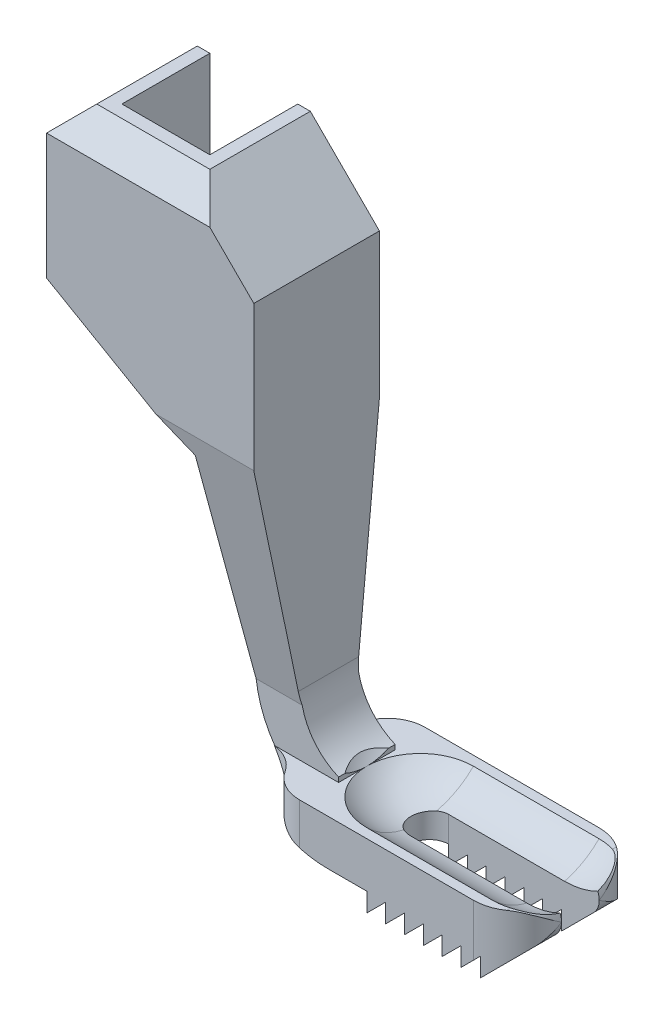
ISO-10303-21;
HEADER;
FILE_DESCRIPTION(('STEP AP214'),'2;1');
FILE_NAME('part.step','',(''),(''),'','','');
FILE_SCHEMA(('AUTOMOTIVE_DESIGN { 1 0 10303 214 1 1 1 1 }'));
ENDSEC;
DATA;
#1=APPLICATION_CONTEXT('core data for automotive mechanical design processes');
#2=APPLICATION_PROTOCOL_DEFINITION('international standard','automotive_design',2000,#1);
#3=PRODUCT_CONTEXT('',#1,'mechanical');
#4=PRODUCT('Part','Part','',(#3));
#5=PRODUCT_RELATED_PRODUCT_CATEGORY('part','',(#4));
#6=PRODUCT_DEFINITION_FORMATION('','',#4);
#7=PRODUCT_DEFINITION_CONTEXT('part definition',#1,'design');
#8=PRODUCT_DEFINITION('design','',#6,#7);
#9=PRODUCT_DEFINITION_SHAPE('','',#8);
#10=(LENGTH_UNIT() NAMED_UNIT(*) SI_UNIT(.MILLI.,.METRE.));
#11=(NAMED_UNIT(*) PLANE_ANGLE_UNIT() SI_UNIT($,.RADIAN.));
#12=(NAMED_UNIT(*) SI_UNIT($,.STERADIAN.) SOLID_ANGLE_UNIT());
#13=UNCERTAINTY_MEASURE_WITH_UNIT(LENGTH_MEASURE(1.E-05),#10,'distance_accuracy_value','');
#14=(GEOMETRIC_REPRESENTATION_CONTEXT(3) GLOBAL_UNCERTAINTY_ASSIGNED_CONTEXT((#13)) GLOBAL_UNIT_ASSIGNED_CONTEXT((#10,
#11,#12)) REPRESENTATION_CONTEXT('',''));
#15=CARTESIAN_POINT('',(0.,0.,0.));
#16=DIRECTION('',(0.,0.,1.));
#17=DIRECTION('',(1.,0.,0.));
#18=AXIS2_PLACEMENT_3D('',#15,#16,#17);
#19=CARTESIAN_POINT('',(-21.3786796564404,34.026790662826,-4.));
#20=DIRECTION('',(0.,0.,1.));
#21=DIRECTION('',(0.,-1.,0.));
#22=AXIS2_PLACEMENT_3D('',#19,#20,#21);
#23=PLANE('',#22);
#24=DIRECTION('',(1.,0.,0.));
#25=VECTOR('',#24,1.);
#26=CARTESIAN_POINT('',(-21.3786796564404,34.026790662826,-4.));
#27=LINE('',#26,#25);
#28=CARTESIAN_POINT('',(-19.3786796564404,34.026790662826,-4.));
#29=VERTEX_POINT('',#28);
#30=CARTESIAN_POINT('',(-18.3786796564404,34.026790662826,-4.));
#31=VERTEX_POINT('',#30);
#32=EDGE_CURVE('E898',#29,#31,#27,.T.);
#33=ORIENTED_EDGE('',*,*,#32,.T.);
#34=DIRECTION('',(0.,1.,0.));
#35=VECTOR('',#34,1.);
#36=CARTESIAN_POINT('',(-18.3786796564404,-10.,-4.));
#37=LINE('',#36,#35);
#38=CARTESIAN_POINT('',(-18.3786796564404,20.2947398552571,-4.));
#39=VERTEX_POINT('',#38);
#40=EDGE_CURVE('E477',#39,#31,#37,.T.);
#41=ORIENTED_EDGE('',*,*,#40,.F.);
#42=DIRECTION('',(-0.866025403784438,0.500000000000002,0.));
#43=VECTOR('',#42,1.);
#44=CARTESIAN_POINT('',(-21.3786796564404,22.026790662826,-4.));
#45=LINE('',#44,#43);
#46=CARTESIAN_POINT('',(-21.3786796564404,22.026790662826,-4.));
#47=VERTEX_POINT('',#46);
#48=EDGE_CURVE('E913',#39,#47,#45,.T.);
#49=ORIENTED_EDGE('',*,*,#48,.T.);
#50=DIRECTION('',(0.,-1.,0.));
#51=VECTOR('',#50,1.);
#52=CARTESIAN_POINT('',(-21.3786796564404,34.026790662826,-4.));
#53=LINE('',#52,#51);
#54=CARTESIAN_POINT('',(-21.3786796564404,32.026790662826,-4.));
#55=VERTEX_POINT('',#54);
#56=EDGE_CURVE('E906',#55,#47,#53,.T.);
#57=ORIENTED_EDGE('',*,*,#56,.F.);
#58=DIRECTION('',(-0.707106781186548,-0.707106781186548,0.));
#59=VECTOR('',#58,1.);
#60=CARTESIAN_POINT('',(-19.3786796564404,34.026790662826,-4.));
#61=LINE('',#60,#59);
#62=EDGE_CURVE('E41',#55,#29,#61,.F.);
#63=ORIENTED_EDGE('',*,*,#62,.T.);
#64=EDGE_LOOP('',(#33,#41,#49,#57,#63));
#65=FACE_BOUND('',#64,.T.);
#66=ADVANCED_FACE('F33',(#65),#23,.F.);
#67=CARTESIAN_POINT('',(13.6213203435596,-4.87867965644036,-6.));
#68=DIRECTION('',(0.,1.,0.));
#69=DIRECTION('',(-1.,0.,0.));
#70=AXIS2_PLACEMENT_3D('',#67,#68,#69);
#71=PLANE('',#70);
#72=DIRECTION('',(0.,0.,1.));
#73=VECTOR('',#72,1.);
#74=CARTESIAN_POINT('',(13.6213203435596,-4.87867965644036,-6.));
#75=LINE('',#74,#73);
#76=CARTESIAN_POINT('',(13.6213203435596,-4.87867965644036,-4.37228132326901));
#77=VERTEX_POINT('',#76);
#78=CARTESIAN_POINT('',(13.6213203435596,-4.87867965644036,-4.05204239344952));
#79=VERTEX_POINT('',#78);
#80=EDGE_CURVE('E769',#77,#79,#75,.T.);
#81=ORIENTED_EDGE('',*,*,#80,.F.);
#82=CARTESIAN_POINT('',(11.6213203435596,-4.87867965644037,-1.5));
#83=DIRECTION('',(0.,1.,0.));
#84=DIRECTION('',(-1.,0.,0.));
#85=AXIS2_PLACEMENT_3D('',#82,#83,#84);
#86=CIRCLE('',#85,3.5);
#87=CARTESIAN_POINT('',(11.6213203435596,-4.87867965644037,-5.));
#88=VERTEX_POINT('',#87);
#89=EDGE_CURVE('E1208',#77,#88,#86,.T.);
#90=ORIENTED_EDGE('',*,*,#89,.T.);
#91=DIRECTION('',(1.,0.,0.));
#92=VECTOR('',#91,1.);
#93=CARTESIAN_POINT('',(-21.3786796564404,-4.87867965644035,-5.00000000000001));
#94=LINE('',#93,#92);
#95=CARTESIAN_POINT('',(-2.24293038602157,-4.87867965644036,-5.00000000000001));
#96=VERTEX_POINT('',#95);
#97=EDGE_CURVE('E900',#96,#88,#94,.T.);
#98=ORIENTED_EDGE('',*,*,#97,.F.);
#99=CARTESIAN_POINT('',(-2.24293038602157,-4.87867965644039,-2.));
#100=DIRECTION('',(0.,1.,0.));
#101=DIRECTION('',(-1.,0.,0.));
#102=AXIS2_PLACEMENT_3D('',#99,#100,#101);
#103=CIRCLE('',#102,3.);
#104=CARTESIAN_POINT('',(-4.76471051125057,-4.8786796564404,-3.625));
#105=VERTEX_POINT('',#104);
#106=EDGE_CURVE('E568',#96,#105,#103,.T.);
#107=ORIENTED_EDGE('',*,*,#106,.T.);
#108=CARTESIAN_POINT('',(-7.28649063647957,-4.8786796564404,-5.25));
#109=DIRECTION('',(0.,1.,0.));
#110=DIRECTION('',(-1.,0.,0.));
#111=AXIS2_PLACEMENT_3D('',#108,#109,#110);
#112=CIRCLE('',#111,3.);
#113=CARTESIAN_POINT('',(-6.96049458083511,-4.8786796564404,-2.26776483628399));
#114=VERTEX_POINT('',#113);
#115=EDGE_CURVE('E558',#105,#114,#112,.F.);
#116=ORIENTED_EDGE('',*,*,#115,.T.);
#117=DIRECTION('',(0.,0.,1.));
#118=VECTOR('',#117,1.);
#119=CARTESIAN_POINT('',(-6.96049458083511,-4.87867965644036,-6.));
#120=LINE('',#119,#118);
#121=CARTESIAN_POINT('',(-6.96049458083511,-4.87867965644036,-2.25));
#122=VERTEX_POINT('',#121);
#123=EDGE_CURVE('E915',#114,#122,#120,.T.);
#124=ORIENTED_EDGE('',*,*,#123,.T.);
#125=DIRECTION('',(1.,0.,0.));
#126=VECTOR('',#125,1.);
#127=CARTESIAN_POINT('',(-21.3786796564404,-4.87867965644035,-2.25));
#128=LINE('',#127,#126);
#129=CARTESIAN_POINT('',(-1.87867965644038,-4.87867965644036,-2.25));
#130=VERTEX_POINT('',#129);
#131=EDGE_CURVE('E601',#122,#130,#128,.T.);
#132=ORIENTED_EDGE('',*,*,#131,.T.);
#133=DIRECTION('',(0.,0.,-1.));
#134=VECTOR('',#133,1.);
#135=CARTESIAN_POINT('',(-1.87867965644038,-4.87867965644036,6.));
#136=LINE('',#135,#134);
#137=CARTESIAN_POINT('',(-1.87867965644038,-4.87867965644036,0.));
#138=VERTEX_POINT('',#137);
#139=EDGE_CURVE('E944',#138,#130,#136,.T.);
#140=ORIENTED_EDGE('',*,*,#139,.F.);
#141=CARTESIAN_POINT('',(2.36396103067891,-4.87867965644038,0.));
#142=DIRECTION('',(0.,1.,0.));
#143=DIRECTION('',(-1.,0.,0.));
#144=AXIS2_PLACEMENT_3D('',#141,#142,#143);
#145=CIRCLE('',#144,4.24264068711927);
#146=CARTESIAN_POINT('',(2.3639610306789,-4.87867965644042,-4.24264068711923));
#147=VERTEX_POINT('',#146);
#148=EDGE_CURVE('E864',#147,#138,#145,.T.);
#149=ORIENTED_EDGE('',*,*,#148,.F.);
#150=DIRECTION('',(-1.,0.,0.));
#151=VECTOR('',#150,1.);
#152=CARTESIAN_POINT('',(-17.4747486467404,-4.87867965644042,-4.24264068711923));
#153=LINE('',#152,#151);
#154=CARTESIAN_POINT('',(12.3639610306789,-4.87867965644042,-4.24264068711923));
#155=VERTEX_POINT('',#154);
#156=EDGE_CURVE('E844',#155,#147,#153,.T.);
#157=ORIENTED_EDGE('',*,*,#156,.F.);
#158=CARTESIAN_POINT('',(12.3639610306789,-4.87867965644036,0.));
#159=DIRECTION('',(0.,1.,0.));
#160=DIRECTION('',(-1.,0.,0.));
#161=AXIS2_PLACEMENT_3D('',#158,#159,#160);
#162=CIRCLE('',#161,4.24264068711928);
#163=EDGE_CURVE('E843',#79,#155,#162,.T.);
#164=ORIENTED_EDGE('',*,*,#163,.F.);
#165=EDGE_LOOP('',(#81,#90,#98,#107,#116,#124,#132,#140,#149,#157,#164));
#166=FACE_BOUND('',#165,.T.);
#167=ADVANCED_FACE('F885',(#166),#71,.T.);
#168=CARTESIAN_POINT('',(13.6213203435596,-6.37867965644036,-6.));
#169=DIRECTION('',(0.,0.,1.));
#170=DIRECTION('',(1.,0.,0.));
#171=AXIS2_PLACEMENT_3D('',#168,#169,#170);
#172=CYLINDRICAL_SURFACE('',#171,1.5);
#173=DIRECTION('',(0.,0.,1.));
#174=VECTOR('',#173,1.);
#175=CARTESIAN_POINT('',(14.6819805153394,-7.43933982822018,-6.));
#176=LINE('',#175,#174);
#177=CARTESIAN_POINT('',(14.6819805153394,-7.43933982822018,-3.19775125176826));
#178=VERTEX_POINT('',#177);
#179=CARTESIAN_POINT('',(14.6819805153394,-7.43933982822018,-1.5));
#180=VERTEX_POINT('',#179);
#181=EDGE_CURVE('E772',#178,#180,#176,.T.);
#182=ORIENTED_EDGE('',*,*,#181,.F.);
#183=CARTESIAN_POINT('',(14.6819805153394,-7.43933982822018,-3.19775125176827));
#184=CARTESIAN_POINT('',(14.7319860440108,-7.38928250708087,-3.10756668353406));
#185=CARTESIAN_POINT('',(14.777428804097,-7.33681673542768,-3.01628566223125));
#186=CARTESIAN_POINT('',(14.859489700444,-7.22814698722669,-2.83208425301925));
#187=CARTESIAN_POINT('',(14.8961140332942,-7.1719456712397,-2.73916506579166));
#188=CARTESIAN_POINT('',(14.9607853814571,-7.05702888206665,-2.55246790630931));
#189=CARTESIAN_POINT('',(14.9888644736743,-6.99832377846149,-2.45869454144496));
#190=CARTESIAN_POINT('',(15.0368846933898,-6.87899410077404,-2.27030498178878));
#191=CARTESIAN_POINT('',(15.0568263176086,-6.81836964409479,-2.17568883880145));
#192=CARTESIAN_POINT('',(15.0887496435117,-6.69593537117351,-1.98598435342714));
#193=CARTESIAN_POINT('',(15.1007364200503,-6.63412633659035,-1.89089635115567));
#194=CARTESIAN_POINT('',(15.1168776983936,-6.50992805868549,-1.70049661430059));
#195=CARTESIAN_POINT('',(15.1210368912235,-6.44753918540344,-1.60518504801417));
#196=CARTESIAN_POINT('',(15.1213156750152,-6.38300012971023,-1.50659963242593));
#197=CARTESIAN_POINT('',(15.1213203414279,-6.38083988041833,-1.50329979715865));
#198=CARTESIAN_POINT('',(15.1213203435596,-6.37867965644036,-1.5));
#199=B_SPLINE_CURVE_WITH_KNOTS('',3,(#183,#184,#185,#186,#187,#188,#189,#190,#191,#192,#193,
#194,#195,#196,#197,#198),.UNSPECIFIED.,.F.,.F.,(4,2,2,2,2,2,2,4),(0.,0.34365259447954,
0.6870629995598,1.02916795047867,1.37125201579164,1.71311763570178,2.05477831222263,
2.06661048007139),.UNSPECIFIED.);
#200=CARTESIAN_POINT('',(15.1213203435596,-6.37867965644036,-1.5));
#201=VERTEX_POINT('',#200);
#202=EDGE_CURVE('E505',#178,#201,#199,.T.);
#203=ORIENTED_EDGE('',*,*,#202,.T.);
#204=CARTESIAN_POINT('',(13.6213203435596,-6.37867965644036,-1.5));
#205=DIRECTION('',(0.,0.,-1.));
#206=DIRECTION('',(-1.,0.,0.));
#207=AXIS2_PLACEMENT_3D('',#204,#205,#206);
#208=CIRCLE('',#207,1.5);
#209=EDGE_CURVE('E1096',#180,#201,#208,.F.);
#210=ORIENTED_EDGE('',*,*,#209,.F.);
#211=EDGE_LOOP('',(#182,#203,#210));
#212=FACE_BOUND('',#211,.T.);
#213=ADVANCED_FACE('F518',(#212),#172,.T.);
#214=CARTESIAN_POINT('',(15.0087546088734,-5.80856900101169,-1.5));
#215=VERTEX_POINT('',#214);
#216=EDGE_CURVE('E829',#201,#215,#208,.F.);
#217=ORIENTED_EDGE('',*,*,#216,.F.);
#218=CARTESIAN_POINT('',(13.6213203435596,-4.87867965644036,-4.37228132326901));
#219=CARTESIAN_POINT('',(13.6741210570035,-4.87868361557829,-4.33553168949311));
#220=CARTESIAN_POINT('',(13.7258463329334,-4.88146580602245,-4.29733822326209));
#221=CARTESIAN_POINT('',(13.8267242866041,-4.89194587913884,-4.21850297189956));
#222=CARTESIAN_POINT('',(13.8758817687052,-4.89963419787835,-4.17786608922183));
#223=CARTESIAN_POINT('',(13.970907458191,-4.91918725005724,-4.09487669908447));
#224=CARTESIAN_POINT('',(14.0168048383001,-4.93100717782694,-4.05254674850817));
#225=CARTESIAN_POINT('',(14.1057421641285,-4.95829270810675,-3.96607002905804));
#226=CARTESIAN_POINT('',(14.148780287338,-4.97376060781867,-3.92192212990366));
#227=CARTESIAN_POINT('',(14.3021936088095,-5.03665084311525,-3.75610379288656));
#228=CARTESIAN_POINT('',(14.4034162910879,-5.09389024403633,-3.62953951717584));
#229=CARTESIAN_POINT('',(14.5849963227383,-5.22373934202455,-3.36872349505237));
#230=CARTESIAN_POINT('',(14.6652223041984,-5.29644088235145,-3.23442947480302));
#231=CARTESIAN_POINT('',(14.7847606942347,-5.42902284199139,-3.00145572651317));
#232=CARTESIAN_POINT('',(14.8291686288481,-5.48639510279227,-2.90390387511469));
#233=CARTESIAN_POINT('',(14.9082823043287,-5.60485441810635,-2.70711888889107));
#234=CARTESIAN_POINT('',(14.9429840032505,-5.66594300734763,-2.60788507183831));
#235=CARTESIAN_POINT('',(15.0329204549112,-5.85285504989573,-2.30886776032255));
#236=CARTESIAN_POINT('',(15.0742591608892,-5.98264455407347,-2.10722315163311));
#237=CARTESIAN_POINT('',(15.1131322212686,-6.19970032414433,-1.77342239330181));
#238=CARTESIAN_POINT('',(15.1209339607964,-6.28595098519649,-1.64164604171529));
#239=CARTESIAN_POINT('',(15.1213156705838,-6.37435917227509,-1.50659964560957));
#240=CARTESIAN_POINT('',(15.1213203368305,-6.37651942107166,-1.50329981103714));
#241=CARTESIAN_POINT('',(15.1213203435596,-6.37867965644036,-1.5));
#242=B_SPLINE_CURVE_WITH_KNOTS('',3,(#218,#219,#220,#221,#222,#223,#224,#225,#226,#227,#228,
#229,#230,#231,#232,#233,#234,#235,#236,#237,#238,#239,#240,#241),.UNSPECIFIED.,.F.,.F.,(4,2,2,
2,2,2,2,2,2,2,2,4),(0.,0.192823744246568,0.385272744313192,0.575696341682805,0.766240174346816,
1.27887864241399,1.79465169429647,2.15889889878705,2.5232975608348,3.2500541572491,
3.72245310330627,3.73428527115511),.UNSPECIFIED.);
#243=EDGE_CURVE('E513',#201,#77,#242,.F.);
#244=ORIENTED_EDGE('',*,*,#243,.T.);
#245=ORIENTED_EDGE('',*,*,#80,.T.);
#246=CARTESIAN_POINT('',(15.008774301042,-5.80861692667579,-1.49979999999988));
#247=CARTESIAN_POINT('',(15.002759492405,-5.79398453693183,-1.56087121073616));
#248=CARTESIAN_POINT('',(14.996158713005,-5.77857001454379,-1.62169297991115));
#249=CARTESIAN_POINT('',(14.9816094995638,-5.74628071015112,-1.74279295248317));
#250=CARTESIAN_POINT('',(14.9736609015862,-5.7294057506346,-1.80307108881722));
#251=CARTESIAN_POINT('',(14.9474806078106,-5.67664809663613,-1.98335554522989));
#252=CARTESIAN_POINT('',(14.926947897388,-5.63872041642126,-2.10245000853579));
#253=CARTESIAN_POINT('',(14.878007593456,-5.55833671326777,-2.33810400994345));
#254=CARTESIAN_POINT('',(14.8495640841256,-5.51586059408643,-2.45464930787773));
#255=CARTESIAN_POINT('',(14.7828985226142,-5.42800728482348,-2.68363459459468));
#256=CARTESIAN_POINT('',(14.7446920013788,-5.38263478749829,-2.79608078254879));
#257=CARTESIAN_POINT('',(14.663758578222,-5.29881749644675,-2.99674291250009));
#258=CARTESIAN_POINT('',(14.6229512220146,-5.2605292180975,-3.08579020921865));
#259=CARTESIAN_POINT('',(14.5313085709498,-5.18475042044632,-3.25927912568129));
#260=CARTESIAN_POINT('',(14.480454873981,-5.14726150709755,-3.34371192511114));
#261=CARTESIAN_POINT('',(14.3661722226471,-5.07489984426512,-3.5070017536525));
#262=CARTESIAN_POINT('',(14.3025788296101,-5.04007052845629,-3.58576534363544));
#263=CARTESIAN_POINT('',(14.1618442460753,-4.97735296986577,-3.73253313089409));
#264=CARTESIAN_POINT('',(14.0848195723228,-4.94940965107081,-3.80062100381));
#265=CARTESIAN_POINT('',(13.9438393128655,-4.91260420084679,-3.90128517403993));
#266=CARTESIAN_POINT('',(13.8839023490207,-4.90048932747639,-3.93817953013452));
#267=CARTESIAN_POINT('',(13.7572617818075,-4.88345767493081,-4.00292291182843));
#268=CARTESIAN_POINT('',(13.6904666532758,-4.87865698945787,-4.03062070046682));
#269=CARTESIAN_POINT('',(13.6211203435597,-4.87867966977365,-4.05210443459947));
#270=B_SPLINE_CURVE_WITH_KNOTS('',3,(#246,#247,#248,#249,#250,#251,#252,#253,#254,#255,#256,
#257,#258,#259,#260,#261,#262,#263,#264,#265,#266,#267,#268,#269),.UNSPECIFIED.,.F.,.F.,(4,2,2,
2,2,2,2,2,2,2,2,4),(0.,0.189243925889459,0.378510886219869,0.758164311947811,1.13957035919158,
1.52037340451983,1.83542562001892,2.15106036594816,2.47106739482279,2.7884251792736,
3.00153168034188,3.21798669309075),.UNSPECIFIED.);
#271=EDGE_CURVE('E835',#215,#79,#270,.T.);
#272=ORIENTED_EDGE('',*,*,#271,.F.);
#273=EDGE_LOOP('',(#217,#244,#245,#272));
#274=FACE_BOUND('',#273,.T.);
#275=ADVANCED_FACE('F840',(#274),#172,.T.);
#276=CARTESIAN_POINT('',(12.1213203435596,-10.,-6.));
#277=DIRECTION('',(0.707106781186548,-0.707106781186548,0.));
#278=DIRECTION('',(0.707106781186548,0.707106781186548,0.));
#279=AXIS2_PLACEMENT_3D('',#276,#277,#278);
#280=PLANE('',#279);
#281=DIRECTION('',(0.,0.,1.));
#282=VECTOR('',#281,1.);
#283=CARTESIAN_POINT('',(12.1213203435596,-10.,-6.));
#284=LINE('',#283,#282);
#285=CARTESIAN_POINT('',(12.1213203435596,-10.,-4.96410161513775));
#286=VERTEX_POINT('',#285);
#287=CARTESIAN_POINT('',(12.1213203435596,-10.,-1.5));
#288=VERTEX_POINT('',#287);
#289=EDGE_CURVE('E775',#286,#288,#284,.T.);
#290=ORIENTED_EDGE('',*,*,#289,.F.);
#291=CARTESIAN_POINT('',(11.6213203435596,-10.5,-1.5));
#292=DIRECTION('',(0.707106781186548,-0.707106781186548,0.));
#293=DIRECTION('',(0.707106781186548,0.707106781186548,0.));
#294=AXIS2_PLACEMENT_3D('',#291,#292,#293);
#295=ELLIPSE('',#294,4.94974746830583,3.5);
#296=EDGE_CURVE('E502',#286,#178,#295,.T.);
#297=ORIENTED_EDGE('',*,*,#296,.T.);
#298=ORIENTED_EDGE('',*,*,#181,.T.);
#299=DIRECTION('',(0.707106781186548,0.707106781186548,0.));
#300=VECTOR('',#299,1.);
#301=CARTESIAN_POINT('',(12.1213203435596,-10.,-1.5));
#302=LINE('',#301,#300);
#303=EDGE_CURVE('E1098',#288,#180,#302,.T.);
#304=ORIENTED_EDGE('',*,*,#303,.F.);
#305=EDGE_LOOP('',(#290,#297,#298,#304));
#306=FACE_BOUND('',#305,.T.);
#307=ADVANCED_FACE('F1203',(#306),#280,.T.);
#308=CARTESIAN_POINT('',(12.1213203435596,-8.5,-6.));
#309=DIRECTION('',(-1.,0.,0.));
#310=DIRECTION('',(0.,0.,1.));
#311=AXIS2_PLACEMENT_3D('',#308,#309,#310);
#312=PLANE('',#311);
#313=DIRECTION('',(0.,0.,1.));
#314=VECTOR('',#313,1.);
#315=CARTESIAN_POINT('',(12.1213203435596,-8.5,-6.));
#316=LINE('',#315,#314);
#317=CARTESIAN_POINT('',(12.1213203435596,-8.5,-4.96410161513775));
#318=VERTEX_POINT('',#317);
#319=CARTESIAN_POINT('',(12.1213203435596,-8.5,-1.5));
#320=VERTEX_POINT('',#319);
#321=EDGE_CURVE('E778',#318,#320,#316,.T.);
#322=ORIENTED_EDGE('',*,*,#321,.F.);
#323=DIRECTION('',(0.,1.,0.));
#324=VECTOR('',#323,1.);
#325=CARTESIAN_POINT('',(12.1213203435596,-10.,-4.96410161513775));
#326=LINE('',#325,#324);
#327=EDGE_CURVE('E499',#318,#286,#326,.F.);
#328=ORIENTED_EDGE('',*,*,#327,.T.);
#329=ORIENTED_EDGE('',*,*,#289,.T.);
#330=DIRECTION('',(0.,-1.,0.));
#331=VECTOR('',#330,1.);
#332=CARTESIAN_POINT('',(12.1213203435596,-8.5,-1.5));
#333=LINE('',#332,#331);
#334=EDGE_CURVE('E1101',#320,#288,#333,.T.);
#335=ORIENTED_EDGE('',*,*,#334,.F.);
#336=EDGE_LOOP('',(#322,#328,#329,#335));
#337=FACE_BOUND('',#336,.T.);
#338=ADVANCED_FACE('F1199',(#337),#312,.T.);
#339=CARTESIAN_POINT('',(10.6213203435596,-10.,-6.));
#340=DIRECTION('',(0.707106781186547,-0.707106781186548,0.));
#341=DIRECTION('',(0.707106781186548,0.707106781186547,0.));
#342=AXIS2_PLACEMENT_3D('',#339,#340,#341);
#343=PLANE('',#342);
#344=DIRECTION('',(-0.707106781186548,-0.707106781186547,0.));
#345=VECTOR('',#344,1.);
#346=CARTESIAN_POINT('',(10.6213203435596,-10.,-5.00000000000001));
#347=LINE('',#346,#345);
#348=CARTESIAN_POINT('',(11.6213203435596,-9.,-5.));
#349=VERTEX_POINT('',#348);
#350=CARTESIAN_POINT('',(10.6213203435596,-10.,-5.00000000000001));
#351=VERTEX_POINT('',#350);
#352=EDGE_CURVE('E939',#349,#351,#347,.T.);
#353=ORIENTED_EDGE('',*,*,#352,.F.);
#354=CARTESIAN_POINT('',(11.6213203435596,-9.,-1.5));
#355=DIRECTION('',(0.707106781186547,-0.707106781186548,0.));
#356=DIRECTION('',(0.707106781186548,0.707106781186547,0.));
#357=AXIS2_PLACEMENT_3D('',#354,#355,#356);
#358=ELLIPSE('',#357,4.94974746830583,3.5);
#359=EDGE_CURVE('E496',#349,#318,#358,.T.);
#360=ORIENTED_EDGE('',*,*,#359,.T.);
#361=ORIENTED_EDGE('',*,*,#321,.T.);
#362=DIRECTION('',(0.707106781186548,0.707106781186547,0.));
#363=VECTOR('',#362,1.);
#364=CARTESIAN_POINT('',(10.6213203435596,-10.,-1.5));
#365=LINE('',#364,#363);
#366=CARTESIAN_POINT('',(10.6213203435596,-10.,-1.5));
#367=VERTEX_POINT('',#366);
#368=EDGE_CURVE('E1104',#367,#320,#365,.T.);
#369=ORIENTED_EDGE('',*,*,#368,.F.);
#370=DIRECTION('',(0.,0.,1.));
#371=VECTOR('',#370,1.);
#372=CARTESIAN_POINT('',(10.6213203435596,-10.,-6.));
#373=LINE('',#372,#371);
#374=EDGE_CURVE('E781',#351,#367,#373,.T.);
#375=ORIENTED_EDGE('',*,*,#374,.F.);
#376=EDGE_LOOP('',(#353,#360,#361,#369,#375));
#377=FACE_BOUND('',#376,.T.);
#378=ADVANCED_FACE('F635',(#377),#343,.T.);
#379=CARTESIAN_POINT('',(-21.3786796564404,-4.87867965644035,-5.00000000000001));
#380=DIRECTION('',(0.,0.,1.));
#381=DIRECTION('',(1.,0.,0.));
#382=AXIS2_PLACEMENT_3D('',#379,#380,#381);
#383=PLANE('',#382);
#384=DIRECTION('',(0.,1.,0.));
#385=VECTOR('',#384,1.);
#386=CARTESIAN_POINT('',(11.6213203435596,-10.,-5.));
#387=LINE('',#386,#385);
#388=EDGE_CURVE('E715',#349,#88,#387,.T.);
#389=ORIENTED_EDGE('',*,*,#388,.F.);
#390=ORIENTED_EDGE('',*,*,#352,.T.);
#391=DIRECTION('',(0.,1.,0.));
#392=VECTOR('',#391,1.);
#393=CARTESIAN_POINT('',(10.6213203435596,-8.5,-5.00000000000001));
#394=LINE('',#393,#392);
#395=CARTESIAN_POINT('',(10.6213203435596,-8.5,-5.00000000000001));
#396=VERTEX_POINT('',#395);
#397=EDGE_CURVE('E937',#351,#396,#394,.T.);
#398=ORIENTED_EDGE('',*,*,#397,.T.);
#399=DIRECTION('',(-0.707106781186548,-0.707106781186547,0.));
#400=VECTOR('',#399,1.);
#401=CARTESIAN_POINT('',(9.12132034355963,-10.,-5.00000000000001));
#402=LINE('',#401,#400);
#403=CARTESIAN_POINT('',(9.12132034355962,-10.,-5.00000000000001));
#404=VERTEX_POINT('',#403);
#405=EDGE_CURVE('E935',#396,#404,#402,.T.);
#406=ORIENTED_EDGE('',*,*,#405,.T.);
#407=DIRECTION('',(0.,1.,0.));
#408=VECTOR('',#407,1.);
#409=CARTESIAN_POINT('',(9.12132034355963,-8.5,-5.00000000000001));
#410=LINE('',#409,#408);
#411=CARTESIAN_POINT('',(9.12132034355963,-8.5,-5.00000000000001));
#412=VERTEX_POINT('',#411);
#413=EDGE_CURVE('E933',#404,#412,#410,.T.);
#414=ORIENTED_EDGE('',*,*,#413,.T.);
#415=DIRECTION('',(-0.707106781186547,-0.707106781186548,0.));
#416=VECTOR('',#415,1.);
#417=CARTESIAN_POINT('',(7.62132034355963,-10.,-5.00000000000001));
#418=LINE('',#417,#416);
#419=CARTESIAN_POINT('',(7.62132034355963,-10.,-5.00000000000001));
#420=VERTEX_POINT('',#419);
#421=EDGE_CURVE('E931',#412,#420,#418,.T.);
#422=ORIENTED_EDGE('',*,*,#421,.T.);
#423=DIRECTION('',(0.,1.,0.));
#424=VECTOR('',#423,1.);
#425=CARTESIAN_POINT('',(7.62132034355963,-8.5,-5.00000000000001));
#426=LINE('',#425,#424);
#427=CARTESIAN_POINT('',(7.62132034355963,-8.5,-5.00000000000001));
#428=VERTEX_POINT('',#427);
#429=EDGE_CURVE('E929',#420,#428,#426,.T.);
#430=ORIENTED_EDGE('',*,*,#429,.T.);
#431=DIRECTION('',(-0.707106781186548,-0.707106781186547,0.));
#432=VECTOR('',#431,1.);
#433=CARTESIAN_POINT('',(6.12132034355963,-10.,-5.00000000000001));
#434=LINE('',#433,#432);
#435=CARTESIAN_POINT('',(6.12132034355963,-10.,-5.00000000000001));
#436=VERTEX_POINT('',#435);
#437=EDGE_CURVE('E927',#428,#436,#434,.T.);
#438=ORIENTED_EDGE('',*,*,#437,.T.);
#439=DIRECTION('',(0.,1.,0.));
#440=VECTOR('',#439,1.);
#441=CARTESIAN_POINT('',(6.12132034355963,-8.5,-5.00000000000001));
#442=LINE('',#441,#440);
#443=CARTESIAN_POINT('',(6.12132034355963,-8.5,-5.00000000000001));
#444=VERTEX_POINT('',#443);
#445=EDGE_CURVE('E925',#436,#444,#442,.T.);
#446=ORIENTED_EDGE('',*,*,#445,.T.);
#447=DIRECTION('',(-0.707106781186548,-0.707106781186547,0.));
#448=VECTOR('',#447,1.);
#449=CARTESIAN_POINT('',(4.62132034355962,-10.,-5.00000000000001));
#450=LINE('',#449,#448);
#451=CARTESIAN_POINT('',(4.62132034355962,-9.99999999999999,-5.00000000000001));
#452=VERTEX_POINT('',#451);
#453=EDGE_CURVE('E923',#444,#452,#450,.T.);
#454=ORIENTED_EDGE('',*,*,#453,.T.);
#455=DIRECTION('',(0.,1.,0.));
#456=VECTOR('',#455,1.);
#457=CARTESIAN_POINT('',(4.62132034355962,-8.5,-5.00000000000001));
#458=LINE('',#457,#456);
#459=CARTESIAN_POINT('',(4.62132034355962,-8.5,-5.00000000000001));
#460=VERTEX_POINT('',#459);
#461=EDGE_CURVE('E921',#452,#460,#458,.T.);
#462=ORIENTED_EDGE('',*,*,#461,.T.);
#463=DIRECTION('',(-0.707106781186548,-0.707106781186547,0.));
#464=VECTOR('',#463,1.);
#465=CARTESIAN_POINT('',(3.12132034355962,-10.,-5.00000000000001));
#466=LINE('',#465,#464);
#467=CARTESIAN_POINT('',(3.12132034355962,-9.99999999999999,-5.00000000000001));
#468=VERTEX_POINT('',#467);
#469=EDGE_CURVE('E919',#460,#468,#466,.T.);
#470=ORIENTED_EDGE('',*,*,#469,.T.);
#471=DIRECTION('',(0.,1.,0.));
#472=VECTOR('',#471,1.);
#473=CARTESIAN_POINT('',(3.12132034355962,-8.5,-5.00000000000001));
#474=LINE('',#473,#472);
#475=CARTESIAN_POINT('',(3.12132034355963,-8.5,-5.00000000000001));
#476=VERTEX_POINT('',#475);
#477=EDGE_CURVE('E917',#468,#476,#474,.T.);
#478=ORIENTED_EDGE('',*,*,#477,.T.);
#479=DIRECTION('',(-1.,0.,0.));
#480=VECTOR('',#479,1.);
#481=CARTESIAN_POINT('',(0.,-8.5,-5.00000000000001));
#482=LINE('',#481,#480);
#483=CARTESIAN_POINT('',(0.,-8.5,-5.00000000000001));
#484=VERTEX_POINT('',#483);
#485=EDGE_CURVE('E697',#476,#484,#482,.T.);
#486=ORIENTED_EDGE('',*,*,#485,.T.);
#487=CARTESIAN_POINT('',(0.,0.,-5.00000000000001));
#488=DIRECTION('',(0.,0.,1.));
#489=DIRECTION('',(1.,0.,0.));
#490=AXIS2_PLACEMENT_3D('',#487,#488,#489);
#491=CIRCLE('',#490,8.5);
#492=CARTESIAN_POINT('',(-2.24293038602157,-8.19873546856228,-5.));
#493=VERTEX_POINT('',#492);
#494=EDGE_CURVE('E941',#484,#493,#491,.F.);
#495=ORIENTED_EDGE('',*,*,#494,.T.);
#496=DIRECTION('',(0.,1.,0.));
#497=VECTOR('',#496,1.);
#498=CARTESIAN_POINT('',(-2.24293038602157,-10.,-5.));
#499=LINE('',#498,#497);
#500=EDGE_CURVE('E712',#493,#96,#499,.T.);
#501=ORIENTED_EDGE('',*,*,#500,.T.);
#502=ORIENTED_EDGE('',*,*,#97,.T.);
#503=EDGE_LOOP('',(#389,#390,#398,#406,#414,#422,#430,#438,#446,#454,#462,#470,#478,#486,#495,
#501,#502));
#504=FACE_BOUND('',#503,.T.);
#505=ADVANCED_FACE('F631',(#504),#383,.F.);
#506=DIRECTION('',(1.,0.,0.));
#507=VECTOR('',#506,1.);
#508=CARTESIAN_POINT('',(-21.3786796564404,-4.87867965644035,5.));
#509=LINE('',#508,#507);
#510=CARTESIAN_POINT('',(-2.24293038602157,-4.87867965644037,5.));
#511=VERTEX_POINT('',#510);
#512=CARTESIAN_POINT('',(11.6213203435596,-4.87867965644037,5.));
#513=VERTEX_POINT('',#512);
#514=EDGE_CURVE('E1028',#511,#513,#509,.T.);
#515=ORIENTED_EDGE('',*,*,#514,.T.);
#516=CARTESIAN_POINT('',(11.6213203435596,-4.87867965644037,1.5));
#517=DIRECTION('',(0.,1.,0.));
#518=DIRECTION('',(-1.,0.,0.));
#519=AXIS2_PLACEMENT_3D('',#516,#517,#518);
#520=CIRCLE('',#519,3.5);
#521=CARTESIAN_POINT('',(13.6213203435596,-4.87867965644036,4.37228132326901));
#522=VERTEX_POINT('',#521);
#523=EDGE_CURVE('E552',#513,#522,#520,.T.);
#524=ORIENTED_EDGE('',*,*,#523,.T.);
#525=CARTESIAN_POINT('',(13.6213203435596,-4.87867965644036,4.05204239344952));
#526=VERTEX_POINT('',#525);
#527=EDGE_CURVE('E771',#526,#522,#75,.T.);
#528=ORIENTED_EDGE('',*,*,#527,.F.);
#529=CARTESIAN_POINT('',(12.3639610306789,-4.87867965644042,4.24264068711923));
#530=VERTEX_POINT('',#529);
#531=EDGE_CURVE('E848',#530,#526,#162,.T.);
#532=ORIENTED_EDGE('',*,*,#531,.F.);
#533=DIRECTION('',(-1.,0.,0.));
#534=VECTOR('',#533,1.);
#535=CARTESIAN_POINT('',(-17.4747486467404,-4.87867965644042,4.24264068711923));
#536=LINE('',#535,#534);
#537=CARTESIAN_POINT('',(2.3639610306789,-4.87867965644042,4.24264068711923));
#538=VERTEX_POINT('',#537);
#539=EDGE_CURVE('E849',#538,#530,#536,.F.);
#540=ORIENTED_EDGE('',*,*,#539,.F.);
#541=EDGE_CURVE('E867',#138,#538,#145,.T.);
#542=ORIENTED_EDGE('',*,*,#541,.F.);
#543=CARTESIAN_POINT('',(-1.87867965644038,-4.87867965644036,2.25));
#544=VERTEX_POINT('',#543);
#545=EDGE_CURVE('E945',#544,#138,#136,.T.);
#546=ORIENTED_EDGE('',*,*,#545,.F.);
#547=DIRECTION('',(1.,0.,0.));
#548=VECTOR('',#547,1.);
#549=CARTESIAN_POINT('',(-21.3786796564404,-4.87867965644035,2.25));
#550=LINE('',#549,#548);
#551=CARTESIAN_POINT('',(-6.96049458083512,-4.87867965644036,2.25));
#552=VERTEX_POINT('',#551);
#553=EDGE_CURVE('E996',#552,#544,#550,.T.);
#554=ORIENTED_EDGE('',*,*,#553,.F.);
#555=DIRECTION('',(0.,0.,1.));
#556=VECTOR('',#555,1.);
#557=CARTESIAN_POINT('',(-6.96049458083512,-4.87867965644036,-6.));
#558=LINE('',#557,#556);
#559=CARTESIAN_POINT('',(-6.96049458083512,-4.8786796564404,2.26776483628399));
#560=VERTEX_POINT('',#559);
#561=EDGE_CURVE('E999',#552,#560,#558,.T.);
#562=ORIENTED_EDGE('',*,*,#561,.T.);
#563=CARTESIAN_POINT('',(-7.28649063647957,-4.8786796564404,5.25));
#564=DIRECTION('',(0.,1.,0.));
#565=DIRECTION('',(-1.,0.,0.));
#566=AXIS2_PLACEMENT_3D('',#563,#564,#565);
#567=CIRCLE('',#566,3.);
#568=CARTESIAN_POINT('',(-4.76471051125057,-4.8786796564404,3.625));
#569=VERTEX_POINT('',#568);
#570=EDGE_CURVE('E1322',#560,#569,#567,.F.);
#571=ORIENTED_EDGE('',*,*,#570,.T.);
#572=CARTESIAN_POINT('',(-2.24293038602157,-4.87867965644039,2.));
#573=DIRECTION('',(0.,1.,0.));
#574=DIRECTION('',(-1.,0.,0.));
#575=AXIS2_PLACEMENT_3D('',#572,#573,#574);
#576=CIRCLE('',#575,3.);
#577=EDGE_CURVE('E600',#569,#511,#576,.T.);
#578=ORIENTED_EDGE('',*,*,#577,.T.);
#579=EDGE_LOOP('',(#515,#524,#528,#532,#540,#542,#546,#554,#562,#571,#578));
#580=FACE_BOUND('',#579,.T.);
#581=ADVANCED_FACE('F634',(#580),#71,.T.);
#582=ORIENTED_EDGE('',*,*,#527,.T.);
#583=CARTESIAN_POINT('',(13.6213203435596,-4.87867965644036,4.37228132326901));
#584=CARTESIAN_POINT('',(13.6741210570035,-4.87868361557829,4.33553168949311));
#585=CARTESIAN_POINT('',(13.7258463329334,-4.88146580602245,4.29733822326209));
#586=CARTESIAN_POINT('',(13.8267242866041,-4.89194587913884,4.21850297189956));
#587=CARTESIAN_POINT('',(13.8758817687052,-4.89963419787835,4.17786608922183));
#588=CARTESIAN_POINT('',(13.970907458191,-4.91918725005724,4.09487669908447));
#589=CARTESIAN_POINT('',(14.0168048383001,-4.93100717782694,4.05254674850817));
#590=CARTESIAN_POINT('',(14.1057421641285,-4.95829270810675,3.96607002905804));
#591=CARTESIAN_POINT('',(14.148780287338,-4.97376060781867,3.92192212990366));
#592=CARTESIAN_POINT('',(14.3021936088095,-5.03665084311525,3.75610379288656));
#593=CARTESIAN_POINT('',(14.4034162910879,-5.09389024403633,3.62953951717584));
#594=CARTESIAN_POINT('',(14.5849963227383,-5.22373934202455,3.36872349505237));
#595=CARTESIAN_POINT('',(14.6652223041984,-5.29644088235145,3.23442947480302));
#596=CARTESIAN_POINT('',(14.7847606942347,-5.42902284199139,3.00145572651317));
#597=CARTESIAN_POINT('',(14.8291686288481,-5.48639510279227,2.90390387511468));
#598=CARTESIAN_POINT('',(14.9082823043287,-5.60485441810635,2.70711888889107));
#599=CARTESIAN_POINT('',(14.9429840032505,-5.66594300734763,2.60788507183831));
#600=CARTESIAN_POINT('',(15.0329204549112,-5.85285504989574,2.30886776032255));
#601=CARTESIAN_POINT('',(15.0742591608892,-5.98264455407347,2.1072231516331));
#602=CARTESIAN_POINT('',(15.1131322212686,-6.19970032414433,1.77342239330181));
#603=CARTESIAN_POINT('',(15.1209339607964,-6.2859509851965,1.6416460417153));
#604=CARTESIAN_POINT('',(15.1213156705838,-6.3743591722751,1.50659964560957));
#605=CARTESIAN_POINT('',(15.1213203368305,-6.37651942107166,1.50329981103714));
#606=CARTESIAN_POINT('',(15.1213203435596,-6.37867965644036,1.5));
#607=B_SPLINE_CURVE_WITH_KNOTS('',3,(#583,#584,#585,#586,#587,#588,#589,#590,#591,#592,#593,
#594,#595,#596,#597,#598,#599,#600,#601,#602,#603,#604,#605,#606),.UNSPECIFIED.,.F.,.F.,(4,2,2,
2,2,2,2,2,2,2,2,4),(0.,0.192823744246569,0.385272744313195,0.57569634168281,0.766240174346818,
1.27887864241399,1.79465169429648,2.15889889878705,2.52329756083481,3.25005415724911,
3.72245310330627,3.73428527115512),.UNSPECIFIED.);
#608=CARTESIAN_POINT('',(15.1213203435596,-6.37867965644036,1.5));
#609=VERTEX_POINT('',#608);
#610=EDGE_CURVE('E546',#522,#609,#607,.T.);
#611=ORIENTED_EDGE('',*,*,#610,.T.);
#612=CARTESIAN_POINT('',(13.6213203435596,-6.37867965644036,1.5));
#613=DIRECTION('',(0.,0.,1.));
#614=DIRECTION('',(1.,0.,0.));
#615=AXIS2_PLACEMENT_3D('',#612,#613,#614);
#616=CIRCLE('',#615,1.5);
#617=CARTESIAN_POINT('',(15.0087546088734,-5.80856900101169,1.5));
#618=VERTEX_POINT('',#617);
#619=EDGE_CURVE('E1066',#618,#609,#616,.F.);
#620=ORIENTED_EDGE('',*,*,#619,.F.);
#621=CARTESIAN_POINT('',(13.6211203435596,-4.8786796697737,4.05210443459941));
#622=CARTESIAN_POINT('',(13.692619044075,-4.87865905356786,4.02995320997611));
#623=CARTESIAN_POINT('',(13.7613871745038,-4.88375956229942,4.00120605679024));
#624=CARTESIAN_POINT('',(13.8915221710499,-4.90178525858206,3.93386381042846));
#625=CARTESIAN_POINT('',(13.9529882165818,-4.91458644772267,3.89543027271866));
#626=CARTESIAN_POINT('',(14.0853087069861,-4.95015530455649,3.79924263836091));
#627=CARTESIAN_POINT('',(14.1538826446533,-4.97471981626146,3.73910034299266));
#628=CARTESIAN_POINT('',(14.2804641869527,-5.02948918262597,3.61020595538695));
#629=CARTESIAN_POINT('',(14.3383969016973,-5.05973119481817,3.54139818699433));
#630=CARTESIAN_POINT('',(14.4352720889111,-5.11769234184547,3.41036533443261));
#631=CARTESIAN_POINT('',(14.4757663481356,-5.14494544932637,3.3490550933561));
#632=CARTESIAN_POINT('',(14.5508330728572,-5.200466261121,3.22331032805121));
#633=CARTESIAN_POINT('',(14.5854015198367,-5.22873463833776,3.1588737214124));
#634=CARTESIAN_POINT('',(14.6493754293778,-5.28554796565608,3.02739429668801));
#635=CARTESIAN_POINT('',(14.6787673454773,-5.31409344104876,2.96034518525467));
#636=CARTESIAN_POINT('',(14.7329345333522,-5.37078582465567,2.82423585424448));
#637=CARTESIAN_POINT('',(14.7577084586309,-5.39893261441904,2.75517505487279));
#638=CARTESIAN_POINT('',(14.8113210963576,-5.46420390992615,2.59048256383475));
#639=CARTESIAN_POINT('',(14.8384632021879,-5.50095407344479,2.49415065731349));
#640=CARTESIAN_POINT('',(14.8865820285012,-5.57186741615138,2.29898880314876));
#641=CARTESIAN_POINT('',(14.9075551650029,-5.60602908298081,2.20015743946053));
#642=CARTESIAN_POINT('',(14.944147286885,-5.67052070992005,2.00191584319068));
#643=CARTESIAN_POINT('',(14.9598391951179,-5.70089886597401,1.90253456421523));
#644=CARTESIAN_POINT('',(14.9871391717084,-5.75778505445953,1.70225528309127));
#645=CARTESIAN_POINT('',(14.9987524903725,-5.78429803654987,1.60135940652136));
#646=CARTESIAN_POINT('',(15.0087743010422,-5.80861692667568,1.4997999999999));
#647=B_SPLINE_CURVE_WITH_KNOTS('',3,(#621,#622,#623,#624,#625,#626,#627,#628,#629,#630,#631,
#632,#633,#634,#635,#636,#637,#638,#639,#640,#641,#642,#643,#644,#645,#646),.UNSPECIFIED.,.F.,
.F.,(4,2,2,2,2,2,2,2,2,2,2,2,4),(0.,0.223095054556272,0.44269048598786,0.72455807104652,
1.00833911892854,1.2431200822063,1.47805963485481,1.71360514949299,1.94921923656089,
2.26877998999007,2.58852603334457,2.90365614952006,3.21837910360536),.UNSPECIFIED.);
#648=EDGE_CURVE('E859',#526,#618,#647,.T.);
#649=ORIENTED_EDGE('',*,*,#648,.F.);
#650=EDGE_LOOP('',(#582,#611,#620,#649));
#651=FACE_BOUND('',#650,.T.);
#652=ADVANCED_FACE('F883',(#651),#172,.T.);
#653=CARTESIAN_POINT('',(14.6819805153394,-7.43933982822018,1.5));
#654=VERTEX_POINT('',#653);
#655=EDGE_CURVE('E1067',#609,#654,#616,.F.);
#656=ORIENTED_EDGE('',*,*,#655,.F.);
#657=CARTESIAN_POINT('',(14.6819805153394,-7.43933982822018,3.19775125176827));
#658=CARTESIAN_POINT('',(14.7319860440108,-7.38928250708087,3.10756668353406));
#659=CARTESIAN_POINT('',(14.777428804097,-7.33681673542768,3.01628566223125));
#660=CARTESIAN_POINT('',(14.859489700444,-7.22814698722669,2.83208425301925));
#661=CARTESIAN_POINT('',(14.8961140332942,-7.1719456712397,2.73916506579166));
#662=CARTESIAN_POINT('',(14.9607853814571,-7.05702888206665,2.55246790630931));
#663=CARTESIAN_POINT('',(14.9888644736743,-6.99832377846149,2.45869454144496));
#664=CARTESIAN_POINT('',(15.0368846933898,-6.87899410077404,2.27030498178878));
#665=CARTESIAN_POINT('',(15.0568263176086,-6.81836964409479,2.17568883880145));
#666=CARTESIAN_POINT('',(15.0887496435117,-6.69593537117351,1.98598435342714));
#667=CARTESIAN_POINT('',(15.1007364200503,-6.63412633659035,1.89089635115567));
#668=CARTESIAN_POINT('',(15.1168776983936,-6.50992805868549,1.70049661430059));
#669=CARTESIAN_POINT('',(15.1210368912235,-6.44753918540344,1.60518504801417));
#670=CARTESIAN_POINT('',(15.1213156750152,-6.38300012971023,1.50659963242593));
#671=CARTESIAN_POINT('',(15.1213203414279,-6.38083988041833,1.50329979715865));
#672=CARTESIAN_POINT('',(15.1213203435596,-6.37867965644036,1.5));
#673=B_SPLINE_CURVE_WITH_KNOTS('',3,(#657,#658,#659,#660,#661,#662,#663,#664,#665,#666,#667,
#668,#669,#670,#671,#672),.UNSPECIFIED.,.F.,.F.,(4,2,2,2,2,2,2,4),(0.,0.34365259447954,
0.6870629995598,1.02916795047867,1.37125201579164,1.71311763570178,2.05477831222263,
2.06661048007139),.UNSPECIFIED.);
#674=CARTESIAN_POINT('',(14.6819805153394,-7.43933982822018,3.19775125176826));
#675=VERTEX_POINT('',#674);
#676=EDGE_CURVE('E540',#609,#675,#673,.F.);
#677=ORIENTED_EDGE('',*,*,#676,.T.);
#678=EDGE_CURVE('E774',#654,#675,#176,.T.);
#679=ORIENTED_EDGE('',*,*,#678,.F.);
#680=EDGE_LOOP('',(#656,#677,#679));
#681=FACE_BOUND('',#680,.T.);
#682=ADVANCED_FACE('F889',(#681),#172,.T.);
#683=ORIENTED_EDGE('',*,*,#678,.T.);
#684=CARTESIAN_POINT('',(11.6213203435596,-10.5,1.5));
#685=DIRECTION('',(0.707106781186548,-0.707106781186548,0.));
#686=DIRECTION('',(0.707106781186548,0.707106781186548,0.));
#687=AXIS2_PLACEMENT_3D('',#684,#685,#686);
#688=ELLIPSE('',#687,4.94974746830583,3.5);
#689=CARTESIAN_POINT('',(12.1213203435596,-10.,4.96410161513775));
#690=VERTEX_POINT('',#689);
#691=EDGE_CURVE('E1219',#675,#690,#688,.T.);
#692=ORIENTED_EDGE('',*,*,#691,.T.);
#693=CARTESIAN_POINT('',(12.1213203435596,-10.,1.5));
#694=VERTEX_POINT('',#693);
#695=EDGE_CURVE('E777',#694,#690,#284,.T.);
#696=ORIENTED_EDGE('',*,*,#695,.F.);
#697=DIRECTION('',(-0.707106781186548,-0.707106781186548,0.));
#698=VECTOR('',#697,1.);
#699=CARTESIAN_POINT('',(12.1213203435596,-10.,1.5));
#700=LINE('',#699,#698);
#701=EDGE_CURVE('E1070',#654,#694,#700,.T.);
#702=ORIENTED_EDGE('',*,*,#701,.F.);
#703=EDGE_LOOP('',(#683,#692,#696,#702));
#704=FACE_BOUND('',#703,.T.);
#705=ADVANCED_FACE('F1230',(#704),#280,.T.);
#706=ORIENTED_EDGE('',*,*,#695,.T.);
#707=DIRECTION('',(0.,1.,0.));
#708=VECTOR('',#707,1.);
#709=CARTESIAN_POINT('',(12.1213203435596,-10.,4.96410161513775));
#710=LINE('',#709,#708);
#711=CARTESIAN_POINT('',(12.1213203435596,-8.5,4.96410161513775));
#712=VERTEX_POINT('',#711);
#713=EDGE_CURVE('E1217',#690,#712,#710,.T.);
#714=ORIENTED_EDGE('',*,*,#713,.T.);
#715=CARTESIAN_POINT('',(12.1213203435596,-8.5,1.5));
#716=VERTEX_POINT('',#715);
#717=EDGE_CURVE('E780',#716,#712,#316,.T.);
#718=ORIENTED_EDGE('',*,*,#717,.F.);
#719=DIRECTION('',(0.,1.,0.));
#720=VECTOR('',#719,1.);
#721=CARTESIAN_POINT('',(12.1213203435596,-8.5,1.5));
#722=LINE('',#721,#720);
#723=EDGE_CURVE('E1072',#694,#716,#722,.T.);
#724=ORIENTED_EDGE('',*,*,#723,.F.);
#725=EDGE_LOOP('',(#706,#714,#718,#724));
#726=FACE_BOUND('',#725,.T.);
#727=ADVANCED_FACE('F1235',(#726),#312,.T.);
#728=ORIENTED_EDGE('',*,*,#717,.T.);
#729=CARTESIAN_POINT('',(11.6213203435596,-9.,1.5));
#730=DIRECTION('',(0.707106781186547,-0.707106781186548,0.));
#731=DIRECTION('',(0.707106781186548,0.707106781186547,0.));
#732=AXIS2_PLACEMENT_3D('',#729,#730,#731);
#733=ELLIPSE('',#732,4.94974746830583,3.5);
#734=CARTESIAN_POINT('',(11.6213203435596,-9.,5.));
#735=VERTEX_POINT('',#734);
#736=EDGE_CURVE('E1212',#712,#735,#733,.T.);
#737=ORIENTED_EDGE('',*,*,#736,.T.);
#738=DIRECTION('',(0.707106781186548,0.707106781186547,0.));
#739=VECTOR('',#738,1.);
#740=CARTESIAN_POINT('',(10.6213203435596,-10.,5.));
#741=LINE('',#740,#739);
#742=CARTESIAN_POINT('',(10.6213203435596,-10.,5.));
#743=VERTEX_POINT('',#742);
#744=EDGE_CURVE('E1054',#743,#735,#741,.T.);
#745=ORIENTED_EDGE('',*,*,#744,.F.);
#746=CARTESIAN_POINT('',(10.6213203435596,-10.,1.5));
#747=VERTEX_POINT('',#746);
#748=EDGE_CURVE('E783',#747,#743,#373,.T.);
#749=ORIENTED_EDGE('',*,*,#748,.F.);
#750=DIRECTION('',(-0.707106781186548,-0.707106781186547,0.));
#751=VECTOR('',#750,1.);
#752=CARTESIAN_POINT('',(10.6213203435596,-10.,1.5));
#753=LINE('',#752,#751);
#754=EDGE_CURVE('E1074',#716,#747,#753,.T.);
#755=ORIENTED_EDGE('',*,*,#754,.F.);
#756=EDGE_LOOP('',(#728,#737,#745,#749,#755));
#757=FACE_BOUND('',#756,.T.);
#758=ADVANCED_FACE('F575',(#757),#343,.T.);
#759=CARTESIAN_POINT('',(0.,0.,-6.));
#760=DIRECTION('',(0.,0.,1.));
#761=DIRECTION('',(1.,0.,0.));
#762=AXIS2_PLACEMENT_3D('',#759,#760,#761);
#763=CYLINDRICAL_SURFACE('',#762,8.5);
#764=CARTESIAN_POINT('',(-8.46765493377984,-0.740823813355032,-2.49231058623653));
#765=CARTESIAN_POINT('',(-8.45760885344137,-0.855667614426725,-2.48801999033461));
#766=CARTESIAN_POINT('',(-8.44522718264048,-0.970265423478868,-2.48276949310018));
#767=CARTESIAN_POINT('',(-8.41583143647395,-1.19876713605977,-2.47063677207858));
#768=CARTESIAN_POINT('',(-8.39881784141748,-1.31267111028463,-2.46375471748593));
#769=CARTESIAN_POINT('',(-8.36019599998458,-1.5396008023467,-2.44864636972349));
#770=CARTESIAN_POINT('',(-8.33858800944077,-1.6526265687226,-2.44042015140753));
#771=CARTESIAN_POINT('',(-8.29082199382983,-1.87763162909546,-2.42299392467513));
#772=CARTESIAN_POINT('',(-8.26466386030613,-1.98961089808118,-2.41379389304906));
#773=CARTESIAN_POINT('',(-8.17895372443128,-2.3256042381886,-2.38518286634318));
#774=CARTESIAN_POINT('',(-8.1124818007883,-2.54781722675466,-2.36489705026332));
#775=CARTESIAN_POINT('',(-7.96157530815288,-2.98614049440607,-2.32590581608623));
#776=CARTESIAN_POINT('',(-7.8771448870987,-3.20225216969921,-2.30720003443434));
#777=CARTESIAN_POINT('',(-7.714347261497,-3.57335324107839,-2.27982992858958));
#778=CARTESIAN_POINT('',(-7.63986570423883,-3.72995328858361,-2.26982221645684));
#779=CARTESIAN_POINT('',(-7.48133252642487,-4.03853202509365,-2.2552754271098));
#780=CARTESIAN_POINT('',(-7.39728083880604,-4.19051068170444,-2.25073638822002));
#781=CARTESIAN_POINT('',(-7.22033896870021,-4.48849799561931,-2.24942965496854));
#782=CARTESIAN_POINT('',(-7.12748452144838,-4.6345276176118,-2.25263173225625));
#783=CARTESIAN_POINT('',(-6.93332332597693,-4.92024515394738,-2.26926836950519));
#784=CARTESIAN_POINT('',(-6.83202047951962,-5.05993595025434,-2.28269822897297));
#785=CARTESIAN_POINT('',(-6.65758217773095,-5.28578637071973,-2.31581031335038));
#786=CARTESIAN_POINT('',(-6.58650269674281,-5.3740773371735,-2.33184369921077));
#787=CARTESIAN_POINT('',(-6.44162584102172,-5.54690553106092,-2.37044726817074));
#788=CARTESIAN_POINT('',(-6.36782923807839,-5.63144380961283,-2.39301560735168));
#789=CARTESIAN_POINT('',(-6.21818085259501,-5.79625718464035,-2.44554062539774));
#790=CARTESIAN_POINT('',(-6.14233016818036,-5.87653449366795,-2.47549342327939));
#791=CARTESIAN_POINT('',(-5.9894452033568,-6.03228687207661,-2.54358386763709));
#792=CARTESIAN_POINT('',(-5.91241117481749,-6.10776294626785,-2.58171979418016));
#793=CARTESIAN_POINT('',(-5.7119331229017,-6.29701481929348,-2.69254836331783));
#794=CARTESIAN_POINT('',(-5.58829077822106,-6.40669514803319,-2.77226662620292));
#795=CARTESIAN_POINT('',(-5.40701524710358,-6.55900174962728,-2.91047643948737));
#796=CARTESIAN_POINT('',(-5.34727182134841,-6.60774698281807,-2.95966827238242));
#797=CARTESIAN_POINT('',(-5.23001200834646,-6.70093690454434,-3.06435116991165));
#798=CARTESIAN_POINT('',(-5.17249450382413,-6.74538376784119,-3.11983901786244));
#799=CARTESIAN_POINT('',(-5.06008124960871,-6.83012336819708,-3.23759167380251));
#800=CARTESIAN_POINT('',(-5.00521357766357,-6.87037535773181,-3.29991269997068));
#801=CARTESIAN_POINT('',(-4.89964235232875,-6.94605793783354,-3.43065686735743));
#802=CARTESIAN_POINT('',(-4.84893665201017,-6.98149102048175,-3.49907682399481));
#803=CARTESIAN_POINT('',(-4.75260210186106,-7.04742388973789,-3.64164359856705));
#804=CARTESIAN_POINT('',(-4.70697346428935,-7.07792347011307,-3.71579065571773));
#805=CARTESIAN_POINT('',(-4.62170707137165,-7.13389272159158,-3.86919480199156));
#806=CARTESIAN_POINT('',(-4.58206569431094,-7.15936543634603,-3.9484487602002));
#807=CARTESIAN_POINT('',(-4.51243035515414,-7.20343905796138,-4.1048697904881));
#808=CARTESIAN_POINT('',(-4.48191878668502,-7.22242627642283,-4.18169812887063));
#809=CARTESIAN_POINT('',(-4.42712686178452,-7.25614083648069,-4.33844499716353));
#810=CARTESIAN_POINT('',(-4.40284583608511,-7.270868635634,-4.41836319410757));
#811=CARTESIAN_POINT('',(-4.36082596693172,-7.29615085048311,-4.58099575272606));
#812=CARTESIAN_POINT('',(-4.34312139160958,-7.30668342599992,-4.66372237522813));
#813=CARTESIAN_POINT('',(-4.31470399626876,-7.3234929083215,-4.83082703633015));
#814=CARTESIAN_POINT('',(-4.30399403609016,-7.32976807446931,-4.91520573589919));
#815=CARTESIAN_POINT('',(-4.29692545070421,-7.33392334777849,-5.));
#816=B_SPLINE_CURVE_WITH_KNOTS('',3,(#764,#765,#766,#767,#768,#769,#770,#771,#772,#773,#774,
#775,#776,#777,#778,#779,#780,#781,#782,#783,#784,#785,#786,#787,#788,#789,#790,#791,#792,#793,
#794,#795,#796,#797,#798,#799,#800,#801,#802,#803,#804,#805,#806,#807,#808,#809,#810,#811,#812,
#813,#814,#815),.UNSPECIFIED.,.F.,.F.,(4,2,2,2,2,2,2,2,2,2,2,2,2,2,2,2,2,2,2,2,2,2,2,2,2,4),(0.,
0.346049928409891,0.692063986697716,1.03805878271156,1.38406182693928,2.08171527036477,
2.77920774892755,3.29994315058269,3.82068220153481,4.33939110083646,4.85786175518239,
5.20104676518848,5.54413503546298,5.88704337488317,6.22987971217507,6.7777859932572,
7.0518936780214,7.32586194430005,7.60228265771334,7.8785598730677,8.15484863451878,
8.43096959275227,8.68504107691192,8.93908525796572,9.19443521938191,9.44988951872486),.UNSPECIFIED.);
#817=CARTESIAN_POINT('',(-4.76471051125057,-7.03900090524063,-3.625));
#818=VERTEX_POINT('',#817);
#819=EDGE_CURVE('E561',#114,#818,#816,.T.);
#820=ORIENTED_EDGE('',*,*,#819,.T.);
#821=CARTESIAN_POINT('',(0.,-8.5,-0.00769899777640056));
#822=CARTESIAN_POINT('',(-0.0542665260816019,-8.50000152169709,0.0534071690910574));
#823=CARTESIAN_POINT('',(-0.111043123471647,-8.49948038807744,0.112284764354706));
#824=CARTESIAN_POINT('',(-0.22919806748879,-8.49711444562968,0.225207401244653));
#825=CARTESIAN_POINT('',(-0.290576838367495,-8.49526951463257,0.279251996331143));
#826=CARTESIAN_POINT('',(-0.417483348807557,-8.48997851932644,0.382102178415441));
#827=CARTESIAN_POINT('',(-0.483009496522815,-8.48653306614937,0.430909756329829));
#828=CARTESIAN_POINT('',(-0.617712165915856,-8.47779456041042,0.522960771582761));
#829=CARTESIAN_POINT('',(-0.686888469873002,-8.4725016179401,0.566204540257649));
#830=CARTESIAN_POINT('',(-0.899329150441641,-8.45348074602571,0.687237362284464));
#831=CARTESIAN_POINT('',(-1.04744789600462,-8.43661269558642,0.756281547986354));
#832=CARTESIAN_POINT('',(-1.3514867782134,-8.39327477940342,0.869084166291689));
#833=CARTESIAN_POINT('',(-1.50740181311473,-8.36681112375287,0.912858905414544));
#834=CARTESIAN_POINT('',(-1.8203489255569,-8.30430399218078,0.97431233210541));
#835=CARTESIAN_POINT('',(-1.97734402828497,-8.26838162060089,0.992303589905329));
#836=CARTESIAN_POINT('',(-2.28986293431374,-8.18734518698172,1.00371096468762));
#837=CARTESIAN_POINT('',(-2.44538599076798,-8.14222669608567,0.997115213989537));
#838=CARTESIAN_POINT('',(-2.75697703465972,-8.04219351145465,0.959952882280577));
#839=CARTESIAN_POINT('',(-2.91283421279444,-7.98696784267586,0.928470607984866));
#840=CARTESIAN_POINT('',(-3.21539913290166,-7.87004184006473,0.842370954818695));
#841=CARTESIAN_POINT('',(-3.36210511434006,-7.80834026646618,0.787749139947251));
#842=CARTESIAN_POINT('',(-3.65754414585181,-7.6747067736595,0.651013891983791));
#843=CARTESIAN_POINT('',(-3.80509502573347,-7.60236295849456,0.566748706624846));
#844=CARTESIAN_POINT('',(-4.0837099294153,-7.45641376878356,0.374907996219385));
#845=CARTESIAN_POINT('',(-4.21475428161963,-7.38280700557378,0.267305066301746));
#846=CARTESIAN_POINT('',(-4.46764844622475,-7.23280140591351,0.0209612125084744));
#847=CARTESIAN_POINT('',(-4.58789342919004,-7.15665943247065,-0.11959603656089));
#848=CARTESIAN_POINT('',(-4.80228340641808,-7.01459947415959,-0.423861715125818));
#849=CARTESIAN_POINT('',(-4.89647096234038,-6.94866489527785,-0.587531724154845));
#850=CARTESIAN_POINT('',(-5.03258469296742,-6.85041175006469,-0.887730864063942));
#851=CARTESIAN_POINT('',(-5.08175671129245,-6.81382597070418,-1.0195828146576));
#852=CARTESIAN_POINT('',(-5.16151994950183,-6.75360868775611,-1.29158255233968));
#853=CARTESIAN_POINT('',(-5.19213400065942,-6.7299612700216,-1.43171991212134));
#854=CARTESIAN_POINT('',(-5.23310254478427,-6.69816009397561,-1.71750642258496));
#855=CARTESIAN_POINT('',(-5.24334642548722,-6.69009093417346,-1.86318131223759));
#856=CARTESIAN_POINT('',(-5.24248846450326,-6.69076354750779,-2.15444207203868));
#857=CARTESIAN_POINT('',(-5.23138621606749,-6.69950564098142,-2.30002794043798));
#858=CARTESIAN_POINT('',(-5.19040603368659,-6.73128952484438,-2.57452876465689));
#859=CARTESIAN_POINT('',(-5.16213105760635,-6.75310859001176,-2.70383572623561));
#860=CARTESIAN_POINT('',(-5.089735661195,-6.80783639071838,-2.95543382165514));
#861=CARTESIAN_POINT('',(-5.04560980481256,-6.84074893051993,-3.07772253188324));
#862=CARTESIAN_POINT('',(-4.93835007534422,-6.91863249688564,-3.32457982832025));
#863=CARTESIAN_POINT('',(-4.87380987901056,-6.96445138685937,-3.44826371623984));
#864=CARTESIAN_POINT('',(-4.7298266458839,-7.0630275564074,-3.68356823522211));
#865=CARTESIAN_POINT('',(-4.65037508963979,-7.1157887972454,-3.79518191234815));
#866=CARTESIAN_POINT('',(-4.4611052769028,-7.23626074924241,-4.02638482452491));
#867=CARTESIAN_POINT('',(-4.3483902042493,-7.3048579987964,-4.14314716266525));
#868=CARTESIAN_POINT('',(-4.10622279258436,-7.44368495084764,-4.35674237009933));
#869=CARTESIAN_POINT('',(-3.97675760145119,-7.51391587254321,-4.45355978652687));
#870=CARTESIAN_POINT('',(-3.68577587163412,-7.6612597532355,-4.63654559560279));
#871=CARTESIAN_POINT('',(-3.52227707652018,-7.73811242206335,-4.71979499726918));
#872=CARTESIAN_POINT('',(-3.17996966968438,-7.88494389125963,-4.85583350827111));
#873=CARTESIAN_POINT('',(-3.00116189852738,-7.95492306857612,-4.90862428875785));
#874=CARTESIAN_POINT('',(-2.72851261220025,-8.05072509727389,-4.96182933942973));
#875=CARTESIAN_POINT('',(-2.63849278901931,-8.08068454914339,-4.97521283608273));
#876=CARTESIAN_POINT('',(-2.45674118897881,-8.13777995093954,-4.99376231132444));
#877=CARTESIAN_POINT('',(-2.36501027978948,-8.16491728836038,-4.99893234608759));
#878=CARTESIAN_POINT('',(-2.18067778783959,-8.21606925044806,-5.00076937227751));
#879=CARTESIAN_POINT('',(-2.08807696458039,-8.24008636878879,-4.99744319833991));
#880=CARTESIAN_POINT('',(-1.90280189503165,-8.28483075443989,-4.98210468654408));
#881=CARTESIAN_POINT('',(-1.8101276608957,-8.3055584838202,-4.97009357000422));
#882=CARTESIAN_POINT('',(-1.63545974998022,-8.34160422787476,-4.93904596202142));
#883=CARTESIAN_POINT('',(-1.55337833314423,-8.35726312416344,-4.92089242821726));
#884=CARTESIAN_POINT('',(-1.39060005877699,-8.38588446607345,-4.87760726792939));
#885=CARTESIAN_POINT('',(-1.30990307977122,-8.39884714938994,-4.85247625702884));
#886=CARTESIAN_POINT('',(-1.15053917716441,-8.42215828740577,-4.79532684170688));
#887=CARTESIAN_POINT('',(-1.07187357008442,-8.43250508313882,-4.76330409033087));
#888=CARTESIAN_POINT('',(-0.917338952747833,-8.4507124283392,-4.69258699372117));
#889=CARTESIAN_POINT('',(-0.841468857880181,-8.45857395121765,-4.65389526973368));
#890=CARTESIAN_POINT('',(-0.695594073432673,-8.47179649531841,-4.57148501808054));
#891=CARTESIAN_POINT('',(-0.625478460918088,-8.47723144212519,-4.52797439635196));
#892=CARTESIAN_POINT('',(-0.488987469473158,-8.48619880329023,-4.43526011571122));
#893=CARTESIAN_POINT('',(-0.42261217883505,-8.489731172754,-4.38605632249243));
#894=CARTESIAN_POINT('',(-0.294084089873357,-8.4951546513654,-4.28228374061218));
#895=CARTESIAN_POINT('',(-0.231933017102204,-8.49704509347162,-4.22771278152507));
#896=CARTESIAN_POINT('',(-0.112331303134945,-8.49946872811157,-4.11362097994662));
#897=CARTESIAN_POINT('',(-0.0548803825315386,-8.50000200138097,-4.05410043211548));
#898=CARTESIAN_POINT('',(0.,-8.5,-3.9923010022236));
#899=B_SPLINE_CURVE_WITH_KNOTS('',3,(#821,#822,#823,#824,#825,#826,#827,#828,#829,#830,#831,
#832,#833,#834,#835,#836,#837,#838,#839,#840,#841,#842,#843,#844,#845,#846,#847,#848,#849,#850,
#851,#852,#853,#854,#855,#856,#857,#858,#859,#860,#861,#862,#863,#864,#865,#866,#867,#868,#869,
#870,#871,#872,#873,#874,#875,#876,#877,#878,#879,#880,#881,#882,#883,#884,#885,#886,#887,#888,
#889,#890,#891,#892,#893,#894,#895,#896,#897,#898),.UNSPECIFIED.,.F.,.F.,(4,2,2,2,2,2,2,2,2,2,2,
2,2,2,2,2,2,2,2,2,2,2,2,2,2,2,2,2,2,2,2,2,2,2,2,2,2,2,4),(0.,0.245101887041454,0.49022639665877,
0.73525738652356,0.980273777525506,1.47052519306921,1.96045989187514,2.44440341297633,
2.92858055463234,3.43145202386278,3.93441994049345,4.48614603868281,5.03852355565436,
5.63564891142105,6.23179309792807,6.66626347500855,7.10019824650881,7.5364829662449,
7.9727759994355,8.37353243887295,8.77442644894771,9.21336003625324,9.65254517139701,
10.1790560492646,10.7059733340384,11.2998837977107,11.8937616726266,12.1808670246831,
12.4678305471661,12.7545632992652,13.041255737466,13.2974596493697,13.553640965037,
13.8099843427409,14.0662271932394,14.3140178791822,14.5618144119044,14.8097115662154,
15.0575939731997),.UNSPECIFIED.);
#900=EDGE_CURVE('E1318',#818,#493,#899,.T.);
#901=ORIENTED_EDGE('',*,*,#900,.T.);
#902=ORIENTED_EDGE('',*,*,#494,.F.);
#903=DIRECTION('',(0.,0.,1.));
#904=VECTOR('',#903,1.);
#905=CARTESIAN_POINT('',(0.,-8.5,-6.));
#906=LINE('',#905,#904);
#907=CARTESIAN_POINT('',(0.,-8.5,5.));
#908=VERTEX_POINT('',#907);
#909=EDGE_CURVE('E749',#484,#908,#906,.T.);
#910=ORIENTED_EDGE('',*,*,#909,.T.);
#911=CARTESIAN_POINT('',(0.,0.,5.));
#912=DIRECTION('',(0.,0.,-1.));
#913=DIRECTION('',(-1.,0.,0.));
#914=AXIS2_PLACEMENT_3D('',#911,#912,#913);
#915=CIRCLE('',#914,8.5);
#916=CARTESIAN_POINT('',(-2.24293038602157,-8.19873546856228,5.));
#917=VERTEX_POINT('',#916);
#918=EDGE_CURVE('E1030',#917,#908,#915,.F.);
#919=ORIENTED_EDGE('',*,*,#918,.F.);
#920=CARTESIAN_POINT('',(-2.24293038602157,-8.19873546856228,5.));
#921=CARTESIAN_POINT('',(-2.33131548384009,-8.17457025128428,5.00000862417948));
#922=CARTESIAN_POINT('',(-2.41927779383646,-8.14895639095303,4.99609472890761));
#923=CARTESIAN_POINT('',(-2.59367534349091,-8.09512871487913,4.98070823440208));
#924=CARTESIAN_POINT('',(-2.68011152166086,-8.06691656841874,4.96924045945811));
#925=CARTESIAN_POINT('',(-2.85057223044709,-8.00826732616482,4.93908798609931));
#926=CARTESIAN_POINT('',(-2.93460453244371,-7.97783889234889,4.92043027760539));
#927=CARTESIAN_POINT('',(-3.10006639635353,-7.91501317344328,4.87622281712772));
#928=CARTESIAN_POINT('',(-3.18149557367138,-7.88261559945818,4.85067205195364));
#929=CARTESIAN_POINT('',(-3.4207857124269,-7.78318088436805,4.76429603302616));
#930=CARTESIAN_POINT('',(-3.57420932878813,-7.71370651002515,4.69364494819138));
#931=CARTESIAN_POINT('',(-3.8661172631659,-7.57163092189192,4.52853198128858));
#932=CARTESIAN_POINT('',(-4.00458537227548,-7.49902643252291,4.43404462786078));
#933=CARTESIAN_POINT('',(-4.25619422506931,-7.35895485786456,4.22965543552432));
#934=CARTESIAN_POINT('',(-4.37037045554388,-7.29144715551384,4.12106411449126));
#935=CARTESIAN_POINT('',(-4.52849005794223,-7.19351367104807,3.94485068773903));
#936=CARTESIAN_POINT('',(-4.57898913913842,-7.16143538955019,3.88391743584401));
#937=CARTESIAN_POINT('',(-4.67537998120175,-7.09888200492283,3.75769321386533));
#938=CARTESIAN_POINT('',(-4.72126977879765,-7.06840758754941,3.69240040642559));
#939=CARTESIAN_POINT('',(-4.76471051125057,-7.03900090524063,3.625));
#940=B_SPLINE_CURVE_WITH_KNOTS('',3,(#920,#921,#922,#923,#924,#925,#926,#927,#928,#929,#930,
#931,#932,#933,#934,#935,#936,#937,#938,#939),.UNSPECIFIED.,.F.,.F.,(4,2,2,2,2,2,2,2,2,4),(0.,
0.274752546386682,0.54932979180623,0.822886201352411,1.09648284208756,1.64189224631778,
2.18788696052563,2.70019902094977,2.95616098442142,3.21223151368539),.UNSPECIFIED.);
#941=CARTESIAN_POINT('',(-4.76471051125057,-7.03900090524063,3.625));
#942=VERTEX_POINT('',#941);
#943=EDGE_CURVE('E592',#917,#942,#940,.T.);
#944=ORIENTED_EDGE('',*,*,#943,.T.);
#945=CARTESIAN_POINT('',(-4.29692545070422,-7.33392334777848,5.));
#946=CARTESIAN_POINT('',(-4.3031593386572,-7.33026250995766,4.92530237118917));
#947=CARTESIAN_POINT('',(-4.3122103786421,-7.32495707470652,4.85092678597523));
#948=CARTESIAN_POINT('',(-4.33576868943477,-7.31104162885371,4.70337300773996));
#949=CARTESIAN_POINT('',(-4.35027487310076,-7.30243227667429,4.63019457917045));
#950=CARTESIAN_POINT('',(-4.38451571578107,-7.2819235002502,4.48577884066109));
#951=CARTESIAN_POINT('',(-4.40423429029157,-7.27003419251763,4.41453629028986));
#952=CARTESIAN_POINT('',(-4.44863969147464,-7.24294697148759,4.27428382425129));
#953=CARTESIAN_POINT('',(-4.47332658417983,-7.2277490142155,4.20527393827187));
#954=CARTESIAN_POINT('',(-4.55437287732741,-7.17716929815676,4.0023301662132));
#955=CARTESIAN_POINT('',(-4.6177541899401,-7.13678075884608,3.87233214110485));
#956=CARTESIAN_POINT('',(-4.75983535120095,-7.04281071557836,3.62635068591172));
#957=CARTESIAN_POINT('',(-4.83853834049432,-6.98922650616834,3.51037013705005));
#958=CARTESIAN_POINT('',(-5.00984487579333,-6.86751756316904,3.29122620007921));
#959=CARTESIAN_POINT('',(-5.10279313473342,-6.79900665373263,3.18854854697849));
#960=CARTESIAN_POINT('',(-5.29631896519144,-6.64935635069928,3.00113636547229));
#961=CARTESIAN_POINT('',(-5.39690072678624,-6.56820999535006,2.9164117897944));
#962=CARTESIAN_POINT('',(-5.56966745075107,-6.42163514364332,2.78824356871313));
#963=CARTESIAN_POINT('',(-5.64097607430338,-6.35914596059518,2.74014932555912));
#964=CARTESIAN_POINT('',(-5.784097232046,-6.22924948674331,2.65194744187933));
#965=CARTESIAN_POINT('',(-5.85590991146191,-6.16184072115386,2.61184220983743));
#966=CARTESIAN_POINT('',(-5.99909061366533,-6.02253298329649,2.53908491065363));
#967=CARTESIAN_POINT('',(-6.07045807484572,-5.95062925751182,2.50644090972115));
#968=CARTESIAN_POINT('',(-6.2118855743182,-5.80283978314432,2.44802221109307));
#969=CARTESIAN_POINT('',(-6.28194520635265,-5.72695282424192,2.42224961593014));
#970=CARTESIAN_POINT('',(-6.44962148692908,-5.53844393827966,2.36721981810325));
#971=CARTESIAN_POINT('',(-6.54622589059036,-5.4239770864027,2.34117675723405));
#972=CARTESIAN_POINT('',(-6.73409225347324,-5.18889952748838,2.29972586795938));
#973=CARTESIAN_POINT('',(-6.82535182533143,-5.06828611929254,2.28432275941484));
#974=CARTESIAN_POINT('',(-7.00181880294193,-4.82157497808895,2.26221047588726));
#975=CARTESIAN_POINT('',(-7.08701252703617,-4.69546582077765,2.25552040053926));
#976=CARTESIAN_POINT('',(-7.25058412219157,-4.43871845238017,2.24909853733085));
#977=CARTESIAN_POINT('',(-7.32895987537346,-4.30807885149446,2.24936890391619));
#978=CARTESIAN_POINT('',(-7.51618452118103,-3.97609551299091,2.25668764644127));
#979=CARTESIAN_POINT('',(-7.6205122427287,-3.77226493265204,2.26707956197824));
#980=CARTESIAN_POINT('',(-7.81226984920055,-3.35719766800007,2.29484477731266));
#981=CARTESIAN_POINT('',(-7.89968920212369,-3.14595646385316,2.31222240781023));
#982=CARTESIAN_POINT('',(-8.05709169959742,-2.71758711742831,2.34953311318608));
#983=CARTESIAN_POINT('',(-8.12709490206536,-2.50046606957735,2.36946320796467));
#984=CARTESIAN_POINT('',(-8.24941736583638,-2.06131494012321,2.40801322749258));
#985=CARTESIAN_POINT('',(-8.30174838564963,-1.83928822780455,2.42663401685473));
#986=CARTESIAN_POINT('',(-8.37307116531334,-1.47083614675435,2.45353110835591));
#987=CARTESIAN_POINT('',(-8.39730554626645,-1.32550560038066,2.46313468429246));
#988=CARTESIAN_POINT('',(-8.43817417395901,-1.03386351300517,2.47978866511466));
#989=CARTESIAN_POINT('',(-8.45481996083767,-0.887553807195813,2.48684294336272));
#990=CARTESIAN_POINT('',(-8.46765493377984,-0.740823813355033,2.49231058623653));
#991=B_SPLINE_CURVE_WITH_KNOTS('',3,(#945,#946,#947,#948,#949,#950,#951,#952,#953,#954,#955,
#956,#957,#958,#959,#960,#961,#962,#963,#964,#965,#966,#967,#968,#969,#970,#971,#972,#973,#974,
#975,#976,#977,#978,#979,#980,#981,#982,#983,#984,#985,#986,#987,#988,#989,#990),.UNSPECIFIED.,
.F.,.F.,(4,2,2,2,2,2,2,2,2,2,2,2,2,2,2,2,2,2,2,2,2,2,4),(0.,0.225059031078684,0.450073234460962,
0.674401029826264,0.898731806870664,1.34693203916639,1.79522424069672,2.25689345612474,
2.7188179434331,3.03736327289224,3.35600449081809,3.67498857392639,3.99407014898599,
4.44945083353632,4.90503339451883,5.36161295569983,5.81833384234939,6.50496828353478,
7.19202905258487,7.87829484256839,8.56410310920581,9.00684813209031,9.44891759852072),.UNSPECIFIED.);
#992=EDGE_CURVE('E583',#942,#560,#991,.T.);
#993=ORIENTED_EDGE('',*,*,#992,.T.);
#994=ORIENTED_EDGE('',*,*,#561,.F.);
#995=CARTESIAN_POINT('',(0.,0.,2.25));
#996=DIRECTION('',(0.,0.,-1.));
#997=DIRECTION('',(0.,1.,0.));
#998=AXIS2_PLACEMENT_3D('',#995,#996,#997);
#999=CIRCLE('',#998,8.5);
#1000=CARTESIAN_POINT('',(-8.44097150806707,-0.999999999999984,2.25));
#1001=VERTEX_POINT('',#1000);
#1002=EDGE_CURVE('E1006',#1001,#552,#999,.F.);
#1003=ORIENTED_EDGE('',*,*,#1002,.F.);
#1004=CARTESIAN_POINT('',(0.,0.,2.45833333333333));
#1005=DIRECTION('',(0.,0.203954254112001,-0.978980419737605));
#1006=DIRECTION('',(0.,0.978980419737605,0.203954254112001));
#1007=AXIS2_PLACEMENT_3D('',#1004,#1005,#1006);
#1008=ELLIPSE('',#1007,8.68250255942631,8.5);
#1009=CARTESIAN_POINT('',(-8.46765493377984,-0.740823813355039,2.30399503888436));
#1010=VERTEX_POINT('',#1009);
#1011=EDGE_CURVE('E1026',#1010,#1001,#1008,.F.);
#1012=ORIENTED_EDGE('',*,*,#1011,.F.);
#1013=DIRECTION('',(0.,0.,1.));
#1014=VECTOR('',#1013,1.);
#1015=CARTESIAN_POINT('',(-8.46765493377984,-0.740823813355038,-6.));
#1016=LINE('',#1015,#1014);
#1017=CARTESIAN_POINT('',(-8.46765493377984,-0.740823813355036,-2.2751976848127));
#1018=VERTEX_POINT('',#1017);
#1019=EDGE_CURVE('E755',#1018,#1010,#1016,.T.);
#1020=ORIENTED_EDGE('',*,*,#1019,.F.);
#1021=CARTESIAN_POINT('',(0.,0.,-2.34722222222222));
#1022=DIRECTION('',(0.,0.0967659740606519,0.995307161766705));
#1023=DIRECTION('',(0.,-0.995307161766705,0.0967659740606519));
#1024=AXIS2_PLACEMENT_3D('',#1021,#1022,#1023);
#1025=ELLIPSE('',#1024,8.54007720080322,8.5);
#1026=CARTESIAN_POINT('',(-8.44097150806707,-0.999999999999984,-2.25));
#1027=VERTEX_POINT('',#1026);
#1028=EDGE_CURVE('E1351',#1027,#1018,#1025,.F.);
#1029=ORIENTED_EDGE('',*,*,#1028,.F.);
#1030=CARTESIAN_POINT('',(0.,0.,-2.25));
#1031=DIRECTION('',(0.,0.,1.));
#1032=DIRECTION('',(1.,0.,0.));
#1033=AXIS2_PLACEMENT_3D('',#1030,#1031,#1032);
#1034=CIRCLE('',#1033,8.5);
#1035=EDGE_CURVE('E1001',#122,#1027,#1034,.F.);
#1036=ORIENTED_EDGE('',*,*,#1035,.F.);
#1037=ORIENTED_EDGE('',*,*,#123,.F.);
#1038=EDGE_LOOP('',(#820,#901,#902,#910,#919,#944,#993,#994,#1003,#1012,#1020,#1029,#1036,#1037));
#1039=FACE_BOUND('',#1038,.T.);
#1040=ADVANCED_FACE('F570',(#1039),#763,.T.);
#1041=CARTESIAN_POINT('',(-21.3786796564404,-9.99999999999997,5.));
#1042=DIRECTION('',(0.,0.,-1.));
#1043=DIRECTION('',(-1.,0.,0.));
#1044=AXIS2_PLACEMENT_3D('',#1041,#1042,#1043);
#1045=PLANE('',#1044);
#1046=ORIENTED_EDGE('',*,*,#744,.T.);
#1047=DIRECTION('',(0.,1.,0.));
#1048=VECTOR('',#1047,1.);
#1049=CARTESIAN_POINT('',(11.6213203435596,-10.,5.));
#1050=LINE('',#1049,#1048);
#1051=EDGE_CURVE('E1209',#735,#513,#1050,.T.);
#1052=ORIENTED_EDGE('',*,*,#1051,.T.);
#1053=ORIENTED_EDGE('',*,*,#514,.F.);
#1054=DIRECTION('',(0.,1.,0.));
#1055=VECTOR('',#1054,1.);
#1056=CARTESIAN_POINT('',(-2.24293038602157,-10.,5.));
#1057=LINE('',#1056,#1055);
#1058=EDGE_CURVE('E710',#917,#511,#1057,.T.);
#1059=ORIENTED_EDGE('',*,*,#1058,.F.);
#1060=ORIENTED_EDGE('',*,*,#918,.T.);
#1061=DIRECTION('',(1.,0.,0.));
#1062=VECTOR('',#1061,1.);
#1063=CARTESIAN_POINT('',(0.,-8.5,5.));
#1064=LINE('',#1063,#1062);
#1065=CARTESIAN_POINT('',(3.12132034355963,-8.5,5.));
#1066=VERTEX_POINT('',#1065);
#1067=EDGE_CURVE('E699',#908,#1066,#1064,.T.);
#1068=ORIENTED_EDGE('',*,*,#1067,.T.);
#1069=DIRECTION('',(0.,-1.,0.));
#1070=VECTOR('',#1069,1.);
#1071=CARTESIAN_POINT('',(3.12132034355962,-8.5,5.));
#1072=LINE('',#1071,#1070);
#1073=CARTESIAN_POINT('',(3.12132034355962,-9.99999999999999,5.));
#1074=VERTEX_POINT('',#1073);
#1075=EDGE_CURVE('E1032',#1066,#1074,#1072,.T.);
#1076=ORIENTED_EDGE('',*,*,#1075,.T.);
#1077=DIRECTION('',(0.707106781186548,0.707106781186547,0.));
#1078=VECTOR('',#1077,1.);
#1079=CARTESIAN_POINT('',(3.12132034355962,-10.,5.));
#1080=LINE('',#1079,#1078);
#1081=CARTESIAN_POINT('',(4.62132034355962,-8.5,5.));
#1082=VERTEX_POINT('',#1081);
#1083=EDGE_CURVE('E1034',#1074,#1082,#1080,.T.);
#1084=ORIENTED_EDGE('',*,*,#1083,.T.);
#1085=DIRECTION('',(0.,-1.,0.));
#1086=VECTOR('',#1085,1.);
#1087=CARTESIAN_POINT('',(4.62132034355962,-8.5,5.));
#1088=LINE('',#1087,#1086);
#1089=CARTESIAN_POINT('',(4.62132034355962,-9.99999999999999,5.));
#1090=VERTEX_POINT('',#1089);
#1091=EDGE_CURVE('E1036',#1082,#1090,#1088,.T.);
#1092=ORIENTED_EDGE('',*,*,#1091,.T.);
#1093=DIRECTION('',(0.707106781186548,0.707106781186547,0.));
#1094=VECTOR('',#1093,1.);
#1095=CARTESIAN_POINT('',(4.62132034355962,-10.,5.));
#1096=LINE('',#1095,#1094);
#1097=CARTESIAN_POINT('',(6.12132034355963,-8.5,5.));
#1098=VERTEX_POINT('',#1097);
#1099=EDGE_CURVE('E1038',#1090,#1098,#1096,.T.);
#1100=ORIENTED_EDGE('',*,*,#1099,.T.);
#1101=DIRECTION('',(0.,-1.,0.));
#1102=VECTOR('',#1101,1.);
#1103=CARTESIAN_POINT('',(6.12132034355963,-8.5,5.));
#1104=LINE('',#1103,#1102);
#1105=CARTESIAN_POINT('',(6.12132034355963,-9.99999999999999,5.));
#1106=VERTEX_POINT('',#1105);
#1107=EDGE_CURVE('E1040',#1098,#1106,#1104,.T.);
#1108=ORIENTED_EDGE('',*,*,#1107,.T.);
#1109=DIRECTION('',(0.707106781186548,0.707106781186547,0.));
#1110=VECTOR('',#1109,1.);
#1111=CARTESIAN_POINT('',(6.12132034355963,-10.,5.));
#1112=LINE('',#1111,#1110);
#1113=CARTESIAN_POINT('',(7.62132034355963,-8.5,5.));
#1114=VERTEX_POINT('',#1113);
#1115=EDGE_CURVE('E1042',#1106,#1114,#1112,.T.);
#1116=ORIENTED_EDGE('',*,*,#1115,.T.);
#1117=DIRECTION('',(0.,-1.,0.));
#1118=VECTOR('',#1117,1.);
#1119=CARTESIAN_POINT('',(7.62132034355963,-8.5,5.));
#1120=LINE('',#1119,#1118);
#1121=CARTESIAN_POINT('',(7.62132034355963,-9.99999999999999,5.));
#1122=VERTEX_POINT('',#1121);
#1123=EDGE_CURVE('E1044',#1114,#1122,#1120,.T.);
#1124=ORIENTED_EDGE('',*,*,#1123,.T.);
#1125=DIRECTION('',(0.707106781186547,0.707106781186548,0.));
#1126=VECTOR('',#1125,1.);
#1127=CARTESIAN_POINT('',(7.62132034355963,-10.,5.));
#1128=LINE('',#1127,#1126);
#1129=CARTESIAN_POINT('',(9.12132034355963,-8.5,5.));
#1130=VERTEX_POINT('',#1129);
#1131=EDGE_CURVE('E1046',#1122,#1130,#1128,.T.);
#1132=ORIENTED_EDGE('',*,*,#1131,.T.);
#1133=DIRECTION('',(0.,-1.,0.));
#1134=VECTOR('',#1133,1.);
#1135=CARTESIAN_POINT('',(9.12132034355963,-8.5,5.));
#1136=LINE('',#1135,#1134);
#1137=CARTESIAN_POINT('',(9.12132034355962,-10.,5.));
#1138=VERTEX_POINT('',#1137);
#1139=EDGE_CURVE('E1048',#1130,#1138,#1136,.T.);
#1140=ORIENTED_EDGE('',*,*,#1139,.T.);
#1141=DIRECTION('',(0.707106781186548,0.707106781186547,0.));
#1142=VECTOR('',#1141,1.);
#1143=CARTESIAN_POINT('',(9.12132034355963,-10.,5.));
#1144=LINE('',#1143,#1142);
#1145=CARTESIAN_POINT('',(10.6213203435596,-8.5,5.));
#1146=VERTEX_POINT('',#1145);
#1147=EDGE_CURVE('E1050',#1138,#1146,#1144,.T.);
#1148=ORIENTED_EDGE('',*,*,#1147,.T.);
#1149=DIRECTION('',(0.,-1.,0.));
#1150=VECTOR('',#1149,1.);
#1151=CARTESIAN_POINT('',(10.6213203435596,-8.5,5.));
#1152=LINE('',#1151,#1150);
#1153=EDGE_CURVE('E1052',#1146,#743,#1152,.T.);
#1154=ORIENTED_EDGE('',*,*,#1153,.T.);
#1155=EDGE_LOOP('',(#1046,#1052,#1053,#1059,#1060,#1068,#1076,#1084,#1092,#1100,#1108,#1116,
#1124,#1132,#1140,#1148,#1154));
#1156=FACE_BOUND('',#1155,.T.);
#1157=ADVANCED_FACE('F574',(#1156),#1045,.F.);
#1158=CARTESIAN_POINT('',(0.,0.,-6.));
#1159=DIRECTION('',(0.,0.,1.));
#1160=DIRECTION('',(1.,0.,0.));
#1161=AXIS2_PLACEMENT_3D('',#1158,#1159,#1160);
#1162=CYLINDRICAL_SURFACE('',#1161,4.87867965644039);
#1163=CARTESIAN_POINT('',(0.,0.,-2.25));
#1164=DIRECTION('',(0.,0.,1.));
#1165=DIRECTION('',(1.,0.,0.));
#1166=AXIS2_PLACEMENT_3D('',#1163,#1164,#1165);
#1167=CIRCLE('',#1166,4.87867965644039);
#1168=CARTESIAN_POINT('',(-4.77509321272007,-0.999999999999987,-2.25));
#1169=VERTEX_POINT('',#1168);
#1170=CARTESIAN_POINT('',(-1.87867965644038,-4.50245243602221,-2.25));
#1171=VERTEX_POINT('',#1170);
#1172=EDGE_CURVE('E1353',#1169,#1171,#1167,.T.);
#1173=ORIENTED_EDGE('',*,*,#1172,.F.);
#1174=CARTESIAN_POINT('',(0.,0.,-2.34722222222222));
#1175=DIRECTION('',(0.,0.0967659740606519,0.995307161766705));
#1176=DIRECTION('',(0.,-0.995307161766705,0.0967659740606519));
#1177=AXIS2_PLACEMENT_3D('',#1174,#1175,#1176);
#1178=ELLIPSE('',#1177,4.90168245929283,4.87867965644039);
#1179=CARTESIAN_POINT('',(-4.87867965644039,0.,-2.34722222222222));
#1180=VERTEX_POINT('',#1179);
#1181=EDGE_CURVE('E1341',#1180,#1169,#1178,.T.);
#1182=ORIENTED_EDGE('',*,*,#1181,.F.);
#1183=DIRECTION('',(0.,0.,1.));
#1184=VECTOR('',#1183,1.);
#1185=CARTESIAN_POINT('',(-4.87867965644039,0.,-6.));
#1186=LINE('',#1185,#1184);
#1187=CARTESIAN_POINT('',(-4.87867965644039,0.,2.45833333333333));
#1188=VERTEX_POINT('',#1187);
#1189=EDGE_CURVE('E767',#1180,#1188,#1186,.T.);
#1190=ORIENTED_EDGE('',*,*,#1189,.T.);
#1191=CARTESIAN_POINT('',(0.,0.,2.45833333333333));
#1192=DIRECTION('',(0.,0.203954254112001,-0.978980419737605));
#1193=DIRECTION('',(0.,0.978980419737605,0.203954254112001));
#1194=AXIS2_PLACEMENT_3D('',#1191,#1192,#1193);
#1195=ELLIPSE('',#1194,4.98342924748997,4.87867965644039);
#1196=CARTESIAN_POINT('',(-4.77509321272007,-0.999999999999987,2.25));
#1197=VERTEX_POINT('',#1196);
#1198=EDGE_CURVE('E1017',#1197,#1188,#1195,.T.);
#1199=ORIENTED_EDGE('',*,*,#1198,.F.);
#1200=CARTESIAN_POINT('',(0.,0.,2.25));
#1201=DIRECTION('',(0.,0.,-1.));
#1202=DIRECTION('',(0.,1.,0.));
#1203=AXIS2_PLACEMENT_3D('',#1200,#1201,#1202);
#1204=CIRCLE('',#1203,4.87867965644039);
#1205=CARTESIAN_POINT('',(-1.87867965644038,-4.50245243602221,2.25));
#1206=VERTEX_POINT('',#1205);
#1207=EDGE_CURVE('E1007',#1206,#1197,#1204,.T.);
#1208=ORIENTED_EDGE('',*,*,#1207,.F.);
#1209=DIRECTION('',(0.,0.,1.));
#1210=VECTOR('',#1209,1.);
#1211=CARTESIAN_POINT('',(-1.87867965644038,-4.50245243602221,-6.));
#1212=LINE('',#1211,#1210);
#1213=CARTESIAN_POINT('',(-1.87867965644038,-4.50245243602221,1.74666737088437));
#1214=VERTEX_POINT('',#1213);
#1215=EDGE_CURVE('E951',#1206,#1214,#1212,.F.);
#1216=ORIENTED_EDGE('',*,*,#1215,.T.);
#1217=CARTESIAN_POINT('',(0.000200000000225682,-4.87867965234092,-3.52315679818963));
#1218=CARTESIAN_POINT('',(-0.0672358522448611,-4.87868369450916,-3.47790759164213));
#1219=CARTESIAN_POINT('',(-0.13414452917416,-4.87728650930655,-3.43189154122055));
#1220=CARTESIAN_POINT('',(-0.266730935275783,-4.87183445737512,-3.33827665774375));
#1221=CARTESIAN_POINT('',(-0.332408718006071,-4.86777970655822,-3.29067789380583));
#1222=CARTESIAN_POINT('',(-0.527402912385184,-4.85184088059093,-3.14538071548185));
#1223=CARTESIAN_POINT('',(-0.654614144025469,-4.83618250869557,-3.04522539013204));
#1224=CARTESIAN_POINT('',(-0.902974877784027,-4.79605392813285,-2.83695983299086));
#1225=CARTESIAN_POINT('',(-1.02405413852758,-4.77150024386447,-2.72878223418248));
#1226=CARTESIAN_POINT('',(-1.25703965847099,-4.71547355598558,-2.50468532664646));
#1227=CARTESIAN_POINT('',(-1.36895080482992,-4.68400427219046,-2.38877020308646));
#1228=CARTESIAN_POINT('',(-1.54491129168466,-4.62818803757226,-2.18975363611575));
#1229=CARTESIAN_POINT('',(-1.61216392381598,-4.60512394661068,-2.10911027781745));
#1230=CARTESIAN_POINT('',(-1.74114648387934,-4.5579197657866,-1.94383198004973));
#1231=CARTESIAN_POINT('',(-1.80287779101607,-4.5337799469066,-1.85919804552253));
#1232=CARTESIAN_POINT('',(-1.91980619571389,-4.48551518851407,-1.68592300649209));
#1233=CARTESIAN_POINT('',(-1.97502412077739,-4.4613904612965,-1.59729600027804));
#1234=CARTESIAN_POINT('',(-2.07813251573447,-4.41430568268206,-1.41561738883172));
#1235=CARTESIAN_POINT('',(-2.12602569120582,-4.39134520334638,-1.32256743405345));
#1236=CARTESIAN_POINT('',(-2.23148018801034,-4.33898169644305,-1.09227834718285));
#1237=CARTESIAN_POINT('',(-2.28480040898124,-4.31086146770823,-0.952731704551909));
#1238=CARTESIAN_POINT('',(-2.37046765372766,-4.26436680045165,-0.665828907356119));
#1239=CARTESIAN_POINT('',(-2.40284907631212,-4.24597638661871,-0.518485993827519));
#1240=CARTESIAN_POINT('',(-2.44346638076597,-4.22274774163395,-0.217897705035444));
#1241=CARTESIAN_POINT('',(-2.45147960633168,-4.21803449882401,-0.0646107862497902));
#1242=CARTESIAN_POINT('',(-2.44164420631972,-4.22373072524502,0.240850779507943));
#1243=CARTESIAN_POINT('',(-2.42378486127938,-4.23414646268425,0.393024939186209));
#1244=CARTESIAN_POINT('',(-2.36150650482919,-4.26920862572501,0.705899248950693));
#1245=CARTESIAN_POINT('',(-2.31462004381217,-4.29516871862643,0.865939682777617));
#1246=CARTESIAN_POINT('',(-2.19748304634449,-4.35624654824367,1.17546086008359));
#1247=CARTESIAN_POINT('',(-2.12717336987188,-4.3913874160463,1.32491370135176));
#1248=CARTESIAN_POINT('',(-1.98527849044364,-4.45701015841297,1.58171035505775));
#1249=CARTESIAN_POINT('',(-1.91720308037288,-4.48687414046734,1.69120933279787));
#1250=CARTESIAN_POINT('',(-1.77153844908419,-4.54635599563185,1.90382760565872));
#1251=CARTESIAN_POINT('',(-1.69394348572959,-4.57597370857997,2.00694299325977));
#1252=CARTESIAN_POINT('',(-1.53063414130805,-4.63316088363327,2.20742296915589));
#1253=CARTESIAN_POINT('',(-1.44490505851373,-4.66072646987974,2.30477660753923));
#1254=CARTESIAN_POINT('',(-1.26665469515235,-4.71229355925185,2.4940615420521));
#1255=CARTESIAN_POINT('',(-1.17413283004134,-4.7362947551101,2.58599237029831));
#1256=CARTESIAN_POINT('',(-0.995694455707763,-4.77675253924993,2.75327457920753));
#1257=CARTESIAN_POINT('',(-0.910473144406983,-4.79378356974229,2.829231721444));
#1258=CARTESIAN_POINT('',(-0.736282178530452,-4.82360992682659,2.97759154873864));
#1259=CARTESIAN_POINT('',(-0.647312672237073,-4.83640542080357,3.04999437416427));
#1260=CARTESIAN_POINT('',(-0.466716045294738,-4.85714919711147,3.19102654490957));
#1261=CARTESIAN_POINT('',(-0.375107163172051,-4.86512494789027,3.25967520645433));
#1262=CARTESIAN_POINT('',(-0.189277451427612,-4.87589813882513,3.39377939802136));
#1263=CARTESIAN_POINT('',(-0.0950564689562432,-4.87869527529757,3.45923474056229));
#1264=CARTESIAN_POINT('',(0.000200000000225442,-4.87867965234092,3.52315679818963));
#1265=B_SPLINE_CURVE_WITH_KNOTS('',3,(#1217,#1218,#1219,#1220,#1221,#1222,#1223,#1224,#1225,
#1226,#1227,#1228,#1229,#1230,#1231,#1232,#1233,#1234,#1235,#1236,#1237,#1238,#1239,#1240,#1241,
#1242,#1243,#1244,#1245,#1246,#1247,#1248,#1249,#1250,#1251,#1252,#1253,#1254,#1255,#1256,#1257,
#1258,#1259,#1260,#1261,#1262,#1263,#1264),.UNSPECIFIED.,.F.,.F.,(4,2,2,2,2,2,2,2,2,2,2,2,2,2,2,
2,2,2,2,2,2,2,2,4),(0.,0.243592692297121,0.487174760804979,0.974576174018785,1.46667525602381,
1.95851028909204,2.28085002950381,2.60310902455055,2.92430788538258,3.24538781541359,
3.69976904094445,4.15340188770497,4.61116738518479,5.06912259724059,5.57267570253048,
6.07750996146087,6.47403757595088,6.87080556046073,7.26830484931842,7.66583838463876,
8.01191477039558,8.35797747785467,8.70204884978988,9.04614039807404),.UNSPECIFIED.);
#1266=CARTESIAN_POINT('',(-1.87867965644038,-4.50245243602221,-1.74666737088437));
#1267=VERTEX_POINT('',#1266);
#1268=EDGE_CURVE('E866',#1267,#1214,#1265,.T.);
#1269=ORIENTED_EDGE('',*,*,#1268,.F.);
#1270=EDGE_CURVE('E948',#1267,#1171,#1212,.F.);
#1271=ORIENTED_EDGE('',*,*,#1270,.T.);
#1272=EDGE_LOOP('',(#1173,#1182,#1190,#1199,#1208,#1216,#1269,#1271));
#1273=FACE_BOUND('',#1272,.T.);
#1274=ADVANCED_FACE('F629',(#1273),#1162,.F.);
#1275=CARTESIAN_POINT('',(0.,0.,6.));
#1276=DIRECTION('',(0.,0.,1.));
#1277=DIRECTION('',(1.,0.,0.));
#1278=AXIS2_PLACEMENT_3D('',#1275,#1276,#1277);
#1279=PLANE('',#1278);
#1280=DIRECTION('',(-0.707106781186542,0.707106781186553,0.));
#1281=VECTOR('',#1280,1.);
#1282=CARTESIAN_POINT('',(-4.87867965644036,28.5267906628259,6.));
#1283=LINE('',#1282,#1281);
#1284=CARTESIAN_POINT('',(-4.87867965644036,28.5267906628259,6.));
#1285=VERTEX_POINT('',#1284);
#1286=CARTESIAN_POINT('',(-8.3786796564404,32.026790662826,6.));
#1287=VERTEX_POINT('',#1286);
#1288=EDGE_CURVE('E742',#1285,#1287,#1283,.T.);
#1289=ORIENTED_EDGE('',*,*,#1288,.T.);
#1290=DIRECTION('',(-1.,0.,0.));
#1291=VECTOR('',#1290,1.);
#1292=CARTESIAN_POINT('',(0.,32.026790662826,6.));
#1293=LINE('',#1292,#1291);
#1294=CARTESIAN_POINT('',(-21.3786796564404,32.026790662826,6.));
#1295=VERTEX_POINT('',#1294);
#1296=EDGE_CURVE('E717',#1287,#1295,#1293,.T.);
#1297=ORIENTED_EDGE('',*,*,#1296,.T.);
#1298=DIRECTION('',(0.,-1.,0.));
#1299=VECTOR('',#1298,1.);
#1300=CARTESIAN_POINT('',(-21.3786796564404,34.026790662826,6.));
#1301=LINE('',#1300,#1299);
#1302=CARTESIAN_POINT('',(-21.3786796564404,22.026790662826,6.));
#1303=VERTEX_POINT('',#1302);
#1304=EDGE_CURVE('E739',#1295,#1303,#1301,.T.);
#1305=ORIENTED_EDGE('',*,*,#1304,.T.);
#1306=DIRECTION('',(0.866025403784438,-0.500000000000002,0.));
#1307=VECTOR('',#1306,1.);
#1308=CARTESIAN_POINT('',(-21.3786796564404,22.026790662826,6.));
#1309=LINE('',#1308,#1307);
#1310=CARTESIAN_POINT('',(-12.672022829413,17.,6.));
#1311=VERTEX_POINT('',#1310);
#1312=EDGE_CURVE('E747',#1303,#1311,#1309,.T.);
#1313=ORIENTED_EDGE('',*,*,#1312,.T.);
#1314=DIRECTION('',(1.,0.,0.));
#1315=VECTOR('',#1314,1.);
#1316=CARTESIAN_POINT('',(-21.3786796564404,17.,6.));
#1317=LINE('',#1316,#1315);
#1318=CARTESIAN_POINT('',(-4.87867965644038,17.,6.));
#1319=VERTEX_POINT('',#1318);
#1320=EDGE_CURVE('E1008',#1311,#1319,#1317,.T.);
#1321=ORIENTED_EDGE('',*,*,#1320,.T.);
#1322=DIRECTION('',(0.,1.,0.));
#1323=VECTOR('',#1322,1.);
#1324=CARTESIAN_POINT('',(-4.87867965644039,0.,6.));
#1325=LINE('',#1324,#1323);
#1326=EDGE_CURVE('E751',#1319,#1285,#1325,.T.);
#1327=ORIENTED_EDGE('',*,*,#1326,.T.);
#1328=EDGE_LOOP('',(#1289,#1297,#1305,#1313,#1321,#1327));
#1329=FACE_BOUND('',#1328,.T.);
#1330=ADVANCED_FACE('F737',(#1329),#1279,.T.);
#1331=CARTESIAN_POINT('',(2.36396103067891,-0.636038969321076,0.));
#1332=DIRECTION('',(-1.,0.,0.));
#1333=DIRECTION('',(0.,1.,0.));
#1334=AXIS2_PLACEMENT_3D('',#1331,#1332,#1333);
#1335=SPHERICAL_SURFACE('',#1334,6.);
#1336=CARTESIAN_POINT('',(-1.87867965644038,-0.636038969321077,0.));
#1337=DIRECTION('',(1.,0.,0.));
#1338=DIRECTION('',(0.,1.,0.));
#1339=AXIS2_PLACEMENT_3D('',#1336,#1337,#1338);
#1340=CIRCLE('',#1339,4.24264068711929);
#1341=EDGE_CURVE('E696',#1267,#138,#1340,.F.);
#1342=ORIENTED_EDGE('',*,*,#1341,.F.);
#1343=ORIENTED_EDGE('',*,*,#1268,.T.);
#1344=EDGE_CURVE('E691',#138,#1214,#1340,.F.);
#1345=ORIENTED_EDGE('',*,*,#1344,.F.);
#1346=EDGE_LOOP('',(#1342,#1343,#1345));
#1347=FACE_BOUND('',#1346,.T.);
#1348=ADVANCED_FACE('F652',(#1347),#1335,.F.);
#1349=ORIENTED_EDGE('',*,*,#148,.T.);
#1350=ORIENTED_EDGE('',*,*,#541,.T.);
#1351=CARTESIAN_POINT('',(2.3639610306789,-0.636038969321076,0.));
#1352=DIRECTION('',(-1.,0.,0.));
#1353=DIRECTION('',(0.,0.,1.));
#1354=AXIS2_PLACEMENT_3D('',#1351,#1352,#1353);
#1355=CIRCLE('',#1354,6.);
#1356=CARTESIAN_POINT('',(2.3639610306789,-6.49467303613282,1.29476131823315));
#1357=VERTEX_POINT('',#1356);
#1358=EDGE_CURVE('E952',#1357,#538,#1355,.T.);
#1359=ORIENTED_EDGE('',*,*,#1358,.F.);
#1360=CARTESIAN_POINT('',(2.3641610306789,-6.49464718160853,-1.2948782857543));
#1361=CARTESIAN_POINT('',(2.32782110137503,-6.49934496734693,-1.27362865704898));
#1362=CARTESIAN_POINT('',(2.29238127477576,-6.50392070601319,-1.25085204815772));
#1363=CARTESIAN_POINT('',(2.2235188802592,-6.51280195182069,-1.20238400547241));
#1364=CARTESIAN_POINT('',(2.19009629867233,-6.51710746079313,-1.17669259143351));
#1365=CARTESIAN_POINT('',(2.09326341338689,-6.52956870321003,-1.09552490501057));
#1366=CARTESIAN_POINT('',(2.03319220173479,-6.53728152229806,-1.03589911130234));
#1367=CARTESIAN_POINT('',(1.92384228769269,-6.55129877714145,-0.907295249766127));
#1368=CARTESIAN_POINT('',(1.8745707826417,-6.5576022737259,-0.838310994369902));
#1369=CARTESIAN_POINT('',(1.78829715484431,-6.56862629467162,-0.692954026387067));
#1370=CARTESIAN_POINT('',(1.75129125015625,-6.57334730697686,-0.616583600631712));
#1371=CARTESIAN_POINT('',(1.69082047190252,-6.58105591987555,-0.459073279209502));
#1372=CARTESIAN_POINT('',(1.66728053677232,-6.58405312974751,-0.377962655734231));
#1373=CARTESIAN_POINT('',(1.6341188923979,-6.58827410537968,-0.212884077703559));
#1374=CARTESIAN_POINT('',(1.62449929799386,-6.58949760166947,-0.128915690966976));
#1375=CARTESIAN_POINT('',(1.61948908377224,-6.59013493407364,0.0390015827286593));
#1376=CARTESIAN_POINT('',(1.62402292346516,-6.58955837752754,0.12294818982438));
#1377=CARTESIAN_POINT('',(1.64701740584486,-6.58663247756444,0.288866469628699));
#1378=CARTESIAN_POINT('',(1.66547585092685,-6.5842834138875,0.370838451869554));
#1379=CARTESIAN_POINT('',(1.71574771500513,-6.57787909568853,0.530434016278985));
#1380=CARTESIAN_POINT('',(1.7475504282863,-6.57382520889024,0.60806102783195));
#1381=CARTESIAN_POINT('',(1.82359512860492,-6.56411782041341,0.756898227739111));
#1382=CARTESIAN_POINT('',(1.867842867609,-6.55846357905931,0.828105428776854));
#1383=CARTESIAN_POINT('',(1.96772177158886,-6.54567729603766,0.962421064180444));
#1384=CARTESIAN_POINT('',(2.02340847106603,-6.53853804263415,1.02548744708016));
#1385=CARTESIAN_POINT('',(2.14435101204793,-6.5229991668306,1.14127697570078));
#1386=CARTESIAN_POINT('',(2.2095886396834,-6.51460194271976,1.19401937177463));
#1387=CARTESIAN_POINT('',(2.30654322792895,-6.50209199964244,1.25987643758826));
#1388=CARTESIAN_POINT('',(2.33507459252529,-6.49840731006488,1.27787929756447));
#1389=CARTESIAN_POINT('',(2.3641610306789,-6.49464718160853,1.2948782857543));
#1390=B_SPLINE_CURVE_WITH_KNOTS('',3,(#1360,#1361,#1362,#1363,#1364,#1365,#1366,#1367,#1368,
#1369,#1370,#1371,#1372,#1373,#1374,#1375,#1376,#1377,#1378,#1379,#1380,#1381,#1382,#1383,#1384,
#1385,#1386,#1387,#1388,#1389),.UNSPECIFIED.,.F.,.F.,(4,2,2,2,2,2,2,2,2,2,2,2,2,2,4),(0.,
0.126997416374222,0.25399397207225,0.507656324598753,0.761487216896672,1.01523977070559,
1.26756372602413,1.51992601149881,1.77094368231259,2.02192174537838,2.27269883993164,
2.52359203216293,2.77573335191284,3.02739994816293,3.12912751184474),.UNSPECIFIED.);
#1391=CARTESIAN_POINT('',(2.3639610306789,-6.49467303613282,-1.29476131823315));
#1392=VERTEX_POINT('',#1391);
#1393=EDGE_CURVE('E684',#1392,#1357,#1390,.T.);
#1394=ORIENTED_EDGE('',*,*,#1393,.F.);
#1395=EDGE_CURVE('E954',#147,#1392,#1355,.T.);
#1396=ORIENTED_EDGE('',*,*,#1395,.F.);
#1397=EDGE_LOOP('',(#1349,#1350,#1359,#1394,#1396));
#1398=FACE_BOUND('',#1397,.T.);
#1399=ADVANCED_FACE('F979',(#1398),#1335,.F.);
#1400=CARTESIAN_POINT('',(10.6213203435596,-8.5,-6.));
#1401=DIRECTION('',(-1.,0.,0.));
#1402=DIRECTION('',(0.,0.,1.));
#1403=AXIS2_PLACEMENT_3D('',#1400,#1401,#1402);
#1404=PLANE('',#1403);
#1405=ORIENTED_EDGE('',*,*,#1153,.F.);
#1406=DIRECTION('',(0.,0.,1.));
#1407=VECTOR('',#1406,1.);
#1408=CARTESIAN_POINT('',(10.6213203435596,-8.5,-6.));
#1409=LINE('',#1408,#1407);
#1410=CARTESIAN_POINT('',(10.6213203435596,-8.5,1.5));
#1411=VERTEX_POINT('',#1410);
#1412=EDGE_CURVE('E786',#1411,#1146,#1409,.T.);
#1413=ORIENTED_EDGE('',*,*,#1412,.F.);
#1414=DIRECTION('',(0.,1.,0.));
#1415=VECTOR('',#1414,1.);
#1416=CARTESIAN_POINT('',(10.6213203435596,-8.5,1.5));
#1417=LINE('',#1416,#1415);
#1418=EDGE_CURVE('E1076',#747,#1411,#1417,.T.);
#1419=ORIENTED_EDGE('',*,*,#1418,.F.);
#1420=ORIENTED_EDGE('',*,*,#748,.T.);
#1421=EDGE_LOOP('',(#1405,#1413,#1419,#1420));
#1422=FACE_BOUND('',#1421,.T.);
#1423=ADVANCED_FACE('F1246',(#1422),#1404,.T.);
#1424=CARTESIAN_POINT('',(9.12132034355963,-10.,-6.));
#1425=DIRECTION('',(0.707106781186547,-0.707106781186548,0.));
#1426=DIRECTION('',(0.707106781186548,0.707106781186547,0.));
#1427=AXIS2_PLACEMENT_3D('',#1424,#1425,#1426);
#1428=PLANE('',#1427);
#1429=ORIENTED_EDGE('',*,*,#1147,.F.);
#1430=DIRECTION('',(0.,0.,1.));
#1431=VECTOR('',#1430,1.);
#1432=CARTESIAN_POINT('',(9.12132034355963,-10.,-6.));
#1433=LINE('',#1432,#1431);
#1434=CARTESIAN_POINT('',(9.12132034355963,-10.,1.5));
#1435=VERTEX_POINT('',#1434);
#1436=EDGE_CURVE('E789',#1435,#1138,#1433,.T.);
#1437=ORIENTED_EDGE('',*,*,#1436,.F.);
#1438=DIRECTION('',(-0.707106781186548,-0.707106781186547,0.));
#1439=VECTOR('',#1438,1.);
#1440=CARTESIAN_POINT('',(9.12132034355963,-10.,1.5));
#1441=LINE('',#1440,#1439);
#1442=EDGE_CURVE('E1078',#1411,#1435,#1441,.T.);
#1443=ORIENTED_EDGE('',*,*,#1442,.F.);
#1444=ORIENTED_EDGE('',*,*,#1412,.T.);
#1445=EDGE_LOOP('',(#1429,#1437,#1443,#1444));
#1446=FACE_BOUND('',#1445,.T.);
#1447=ADVANCED_FACE('F1250',(#1446),#1428,.T.);
#1448=CARTESIAN_POINT('',(9.12132034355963,-8.5,-6.));
#1449=DIRECTION('',(-1.,0.,0.));
#1450=DIRECTION('',(0.,0.,1.));
#1451=AXIS2_PLACEMENT_3D('',#1448,#1449,#1450);
#1452=PLANE('',#1451);
#1453=ORIENTED_EDGE('',*,*,#1139,.F.);
#1454=DIRECTION('',(0.,0.,1.));
#1455=VECTOR('',#1454,1.);
#1456=CARTESIAN_POINT('',(9.12132034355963,-8.5,-6.));
#1457=LINE('',#1456,#1455);
#1458=CARTESIAN_POINT('',(9.12132034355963,-8.5,1.5));
#1459=VERTEX_POINT('',#1458);
#1460=EDGE_CURVE('E792',#1459,#1130,#1457,.T.);
#1461=ORIENTED_EDGE('',*,*,#1460,.F.);
#1462=DIRECTION('',(0.,1.,0.));
#1463=VECTOR('',#1462,1.);
#1464=CARTESIAN_POINT('',(9.12132034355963,-8.5,1.5));
#1465=LINE('',#1464,#1463);
#1466=EDGE_CURVE('E1080',#1435,#1459,#1465,.T.);
#1467=ORIENTED_EDGE('',*,*,#1466,.F.);
#1468=ORIENTED_EDGE('',*,*,#1436,.T.);
#1469=EDGE_LOOP('',(#1453,#1461,#1467,#1468));
#1470=FACE_BOUND('',#1469,.T.);
#1471=ADVANCED_FACE('F1258',(#1470),#1452,.T.);
#1472=CARTESIAN_POINT('',(7.62132034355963,-10.,-6.));
#1473=DIRECTION('',(0.707106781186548,-0.707106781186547,0.));
#1474=DIRECTION('',(0.707106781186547,0.707106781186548,0.));
#1475=AXIS2_PLACEMENT_3D('',#1472,#1473,#1474);
#1476=PLANE('',#1475);
#1477=ORIENTED_EDGE('',*,*,#1131,.F.);
#1478=DIRECTION('',(0.,0.,1.));
#1479=VECTOR('',#1478,1.);
#1480=CARTESIAN_POINT('',(7.62132034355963,-10.,-6.));
#1481=LINE('',#1480,#1479);
#1482=CARTESIAN_POINT('',(7.62132034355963,-10.,1.5));
#1483=VERTEX_POINT('',#1482);
#1484=EDGE_CURVE('E795',#1483,#1122,#1481,.T.);
#1485=ORIENTED_EDGE('',*,*,#1484,.F.);
#1486=DIRECTION('',(-0.707106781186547,-0.707106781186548,0.));
#1487=VECTOR('',#1486,1.);
#1488=CARTESIAN_POINT('',(7.62132034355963,-10.,1.5));
#1489=LINE('',#1488,#1487);
#1490=EDGE_CURVE('E1082',#1459,#1483,#1489,.T.);
#1491=ORIENTED_EDGE('',*,*,#1490,.F.);
#1492=ORIENTED_EDGE('',*,*,#1460,.T.);
#1493=EDGE_LOOP('',(#1477,#1485,#1491,#1492));
#1494=FACE_BOUND('',#1493,.T.);
#1495=ADVANCED_FACE('F1262',(#1494),#1476,.T.);
#1496=CARTESIAN_POINT('',(7.62132034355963,-8.5,-6.));
#1497=DIRECTION('',(-1.,0.,0.));
#1498=DIRECTION('',(0.,0.,1.));
#1499=AXIS2_PLACEMENT_3D('',#1496,#1497,#1498);
#1500=PLANE('',#1499);
#1501=ORIENTED_EDGE('',*,*,#1123,.F.);
#1502=DIRECTION('',(0.,0.,1.));
#1503=VECTOR('',#1502,1.);
#1504=CARTESIAN_POINT('',(7.62132034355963,-8.5,-6.));
#1505=LINE('',#1504,#1503);
#1506=CARTESIAN_POINT('',(7.62132034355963,-8.5,1.5));
#1507=VERTEX_POINT('',#1506);
#1508=EDGE_CURVE('E798',#1507,#1114,#1505,.T.);
#1509=ORIENTED_EDGE('',*,*,#1508,.F.);
#1510=DIRECTION('',(0.,1.,0.));
#1511=VECTOR('',#1510,1.);
#1512=CARTESIAN_POINT('',(7.62132034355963,-8.5,1.5));
#1513=LINE('',#1512,#1511);
#1514=EDGE_CURVE('E1084',#1483,#1507,#1513,.T.);
#1515=ORIENTED_EDGE('',*,*,#1514,.F.);
#1516=ORIENTED_EDGE('',*,*,#1484,.T.);
#1517=EDGE_LOOP('',(#1501,#1509,#1515,#1516));
#1518=FACE_BOUND('',#1517,.T.);
#1519=ADVANCED_FACE('F1270',(#1518),#1500,.T.);
#1520=CARTESIAN_POINT('',(6.12132034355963,-10.,-6.));
#1521=DIRECTION('',(0.707106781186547,-0.707106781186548,0.));
#1522=DIRECTION('',(0.707106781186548,0.707106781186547,0.));
#1523=AXIS2_PLACEMENT_3D('',#1520,#1521,#1522);
#1524=PLANE('',#1523);
#1525=ORIENTED_EDGE('',*,*,#1115,.F.);
#1526=DIRECTION('',(0.,0.,1.));
#1527=VECTOR('',#1526,1.);
#1528=CARTESIAN_POINT('',(6.12132034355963,-10.,-6.));
#1529=LINE('',#1528,#1527);
#1530=CARTESIAN_POINT('',(6.12132034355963,-10.,1.5));
#1531=VERTEX_POINT('',#1530);
#1532=EDGE_CURVE('E801',#1531,#1106,#1529,.T.);
#1533=ORIENTED_EDGE('',*,*,#1532,.F.);
#1534=DIRECTION('',(-0.707106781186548,-0.707106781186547,0.));
#1535=VECTOR('',#1534,1.);
#1536=CARTESIAN_POINT('',(6.12132034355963,-10.,1.5));
#1537=LINE('',#1536,#1535);
#1538=EDGE_CURVE('E1086',#1507,#1531,#1537,.T.);
#1539=ORIENTED_EDGE('',*,*,#1538,.F.);
#1540=ORIENTED_EDGE('',*,*,#1508,.T.);
#1541=EDGE_LOOP('',(#1525,#1533,#1539,#1540));
#1542=FACE_BOUND('',#1541,.T.);
#1543=ADVANCED_FACE('F1274',(#1542),#1524,.T.);
#1544=CARTESIAN_POINT('',(6.12132034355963,-8.5,-6.));
#1545=DIRECTION('',(-1.,0.,0.));
#1546=DIRECTION('',(0.,0.,1.));
#1547=AXIS2_PLACEMENT_3D('',#1544,#1545,#1546);
#1548=PLANE('',#1547);
#1549=ORIENTED_EDGE('',*,*,#1107,.F.);
#1550=DIRECTION('',(0.,0.,1.));
#1551=VECTOR('',#1550,1.);
#1552=CARTESIAN_POINT('',(6.12132034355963,-8.5,-6.));
#1553=LINE('',#1552,#1551);
#1554=CARTESIAN_POINT('',(6.12132034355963,-8.5,1.5));
#1555=VERTEX_POINT('',#1554);
#1556=EDGE_CURVE('E804',#1555,#1098,#1553,.T.);
#1557=ORIENTED_EDGE('',*,*,#1556,.F.);
#1558=DIRECTION('',(0.,1.,0.));
#1559=VECTOR('',#1558,1.);
#1560=CARTESIAN_POINT('',(6.12132034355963,-8.5,1.5));
#1561=LINE('',#1560,#1559);
#1562=EDGE_CURVE('E1088',#1531,#1555,#1561,.T.);
#1563=ORIENTED_EDGE('',*,*,#1562,.F.);
#1564=ORIENTED_EDGE('',*,*,#1532,.T.);
#1565=EDGE_LOOP('',(#1549,#1557,#1563,#1564));
#1566=FACE_BOUND('',#1565,.T.);
#1567=ADVANCED_FACE('F1282',(#1566),#1548,.T.);
#1568=CARTESIAN_POINT('',(4.62132034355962,-10.,-6.));
#1569=DIRECTION('',(0.707106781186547,-0.707106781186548,0.));
#1570=DIRECTION('',(0.707106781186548,0.707106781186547,0.));
#1571=AXIS2_PLACEMENT_3D('',#1568,#1569,#1570);
#1572=PLANE('',#1571);
#1573=ORIENTED_EDGE('',*,*,#1099,.F.);
#1574=DIRECTION('',(0.,0.,1.));
#1575=VECTOR('',#1574,1.);
#1576=CARTESIAN_POINT('',(4.62132034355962,-10.,-6.));
#1577=LINE('',#1576,#1575);
#1578=CARTESIAN_POINT('',(4.62132034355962,-10.,1.5));
#1579=VERTEX_POINT('',#1578);
#1580=EDGE_CURVE('E807',#1579,#1090,#1577,.T.);
#1581=ORIENTED_EDGE('',*,*,#1580,.F.);
#1582=DIRECTION('',(-0.707106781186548,-0.707106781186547,0.));
#1583=VECTOR('',#1582,1.);
#1584=CARTESIAN_POINT('',(4.62132034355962,-10.,1.5));
#1585=LINE('',#1584,#1583);
#1586=EDGE_CURVE('E1090',#1555,#1579,#1585,.T.);
#1587=ORIENTED_EDGE('',*,*,#1586,.F.);
#1588=ORIENTED_EDGE('',*,*,#1556,.T.);
#1589=EDGE_LOOP('',(#1573,#1581,#1587,#1588));
#1590=FACE_BOUND('',#1589,.T.);
#1591=ADVANCED_FACE('F1286',(#1590),#1572,.T.);
#1592=CARTESIAN_POINT('',(4.62132034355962,-8.5,-6.));
#1593=DIRECTION('',(-1.,0.,0.));
#1594=DIRECTION('',(0.,0.,1.));
#1595=AXIS2_PLACEMENT_3D('',#1592,#1593,#1594);
#1596=PLANE('',#1595);
#1597=ORIENTED_EDGE('',*,*,#1091,.F.);
#1598=DIRECTION('',(0.,0.,1.));
#1599=VECTOR('',#1598,1.);
#1600=CARTESIAN_POINT('',(4.62132034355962,-8.5,-6.));
#1601=LINE('',#1600,#1599);
#1602=CARTESIAN_POINT('',(4.62132034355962,-8.5,1.5));
#1603=VERTEX_POINT('',#1602);
#1604=EDGE_CURVE('E810',#1603,#1082,#1601,.T.);
#1605=ORIENTED_EDGE('',*,*,#1604,.F.);
#1606=DIRECTION('',(0.,1.,0.));
#1607=VECTOR('',#1606,1.);
#1608=CARTESIAN_POINT('',(4.62132034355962,-8.5,1.5));
#1609=LINE('',#1608,#1607);
#1610=EDGE_CURVE('E1092',#1579,#1603,#1609,.T.);
#1611=ORIENTED_EDGE('',*,*,#1610,.F.);
#1612=ORIENTED_EDGE('',*,*,#1580,.T.);
#1613=EDGE_LOOP('',(#1597,#1605,#1611,#1612));
#1614=FACE_BOUND('',#1613,.T.);
#1615=ADVANCED_FACE('F1294',(#1614),#1596,.T.);
#1616=CARTESIAN_POINT('',(3.12132034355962,-10.,-6.));
#1617=DIRECTION('',(0.707106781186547,-0.707106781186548,0.));
#1618=DIRECTION('',(0.707106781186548,0.707106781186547,0.));
#1619=AXIS2_PLACEMENT_3D('',#1616,#1617,#1618);
#1620=PLANE('',#1619);
#1621=ORIENTED_EDGE('',*,*,#1083,.F.);
#1622=DIRECTION('',(0.,0.,1.));
#1623=VECTOR('',#1622,1.);
#1624=CARTESIAN_POINT('',(3.12132034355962,-10.,-6.));
#1625=LINE('',#1624,#1623);
#1626=CARTESIAN_POINT('',(3.12132034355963,-10.,1.5));
#1627=VERTEX_POINT('',#1626);
#1628=EDGE_CURVE('E813',#1627,#1074,#1625,.T.);
#1629=ORIENTED_EDGE('',*,*,#1628,.F.);
#1630=DIRECTION('',(-0.707106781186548,-0.707106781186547,0.));
#1631=VECTOR('',#1630,1.);
#1632=CARTESIAN_POINT('',(3.12132034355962,-10.,1.5));
#1633=LINE('',#1632,#1631);
#1634=EDGE_CURVE('E1094',#1603,#1627,#1633,.T.);
#1635=ORIENTED_EDGE('',*,*,#1634,.F.);
#1636=ORIENTED_EDGE('',*,*,#1604,.T.);
#1637=EDGE_LOOP('',(#1621,#1629,#1635,#1636));
#1638=FACE_BOUND('',#1637,.T.);
#1639=ADVANCED_FACE('F1298',(#1638),#1620,.T.);
#1640=CARTESIAN_POINT('',(3.12132034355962,-8.5,-6.));
#1641=DIRECTION('',(-1.,0.,0.));
#1642=DIRECTION('',(0.,0.,1.));
#1643=AXIS2_PLACEMENT_3D('',#1640,#1641,#1642);
#1644=PLANE('',#1643);
#1645=ORIENTED_EDGE('',*,*,#1075,.F.);
#1646=DIRECTION('',(0.,0.,1.));
#1647=VECTOR('',#1646,1.);
#1648=CARTESIAN_POINT('',(3.12132034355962,-8.5,-6.));
#1649=LINE('',#1648,#1647);
#1650=CARTESIAN_POINT('',(3.12132034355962,-8.5,1.5));
#1651=VERTEX_POINT('',#1650);
#1652=EDGE_CURVE('E816',#1651,#1066,#1649,.T.);
#1653=ORIENTED_EDGE('',*,*,#1652,.F.);
#1654=DIRECTION('',(0.,1.,0.));
#1655=VECTOR('',#1654,1.);
#1656=CARTESIAN_POINT('',(3.12132034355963,-10.,1.5));
#1657=LINE('',#1656,#1655);
#1658=EDGE_CURVE('E874',#1627,#1651,#1657,.T.);
#1659=ORIENTED_EDGE('',*,*,#1658,.F.);
#1660=ORIENTED_EDGE('',*,*,#1628,.T.);
#1661=EDGE_LOOP('',(#1645,#1653,#1659,#1660));
#1662=FACE_BOUND('',#1661,.T.);
#1663=ADVANCED_FACE('F1305',(#1662),#1644,.T.);
#1664=CARTESIAN_POINT('',(-9.87867965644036,15.3872625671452,-6.));
#1665=DIRECTION('',(-0.996194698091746,-0.0871557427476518,0.));
#1666=DIRECTION('',(0.0871557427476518,-0.996194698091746,0.));
#1667=AXIS2_PLACEMENT_3D('',#1664,#1665,#1666);
#1668=PLANE('',#1667);
#1669=DIRECTION('',(-0.0867498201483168,0.991554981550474,-0.0964011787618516));
#1670=VECTOR('',#1669,1.);
#1671=CARTESIAN_POINT('',(-9.896716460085,15.593424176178,-3.86324957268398));
#1672=LINE('',#1671,#1670);
#1673=CARTESIAN_POINT('',(-9.87867965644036,15.3872625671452,-3.8432060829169));
#1674=VERTEX_POINT('',#1673);
#1675=EDGE_CURVE('E1349',#1018,#1674,#1672,.T.);
#1676=ORIENTED_EDGE('',*,*,#1675,.F.);
#1677=ORIENTED_EDGE('',*,*,#1019,.T.);
#1678=DIRECTION('',(0.0853372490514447,-0.975409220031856,-0.203210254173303));
#1679=VECTOR('',#1678,1.);
#1680=CARTESIAN_POINT('',(-9.6764092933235,13.0753017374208,5.18235452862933));
#1681=LINE('',#1680,#1679);
#1682=CARTESIAN_POINT('',(-9.87867965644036,15.3872625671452,5.66401303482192));
#1683=VERTEX_POINT('',#1682);
#1684=EDGE_CURVE('E1023',#1683,#1010,#1681,.T.);
#1685=ORIENTED_EDGE('',*,*,#1684,.F.);
#1686=DIRECTION('',(0.,0.,1.));
#1687=VECTOR('',#1686,1.);
#1688=CARTESIAN_POINT('',(-9.87867965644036,15.3872625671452,-6.));
#1689=LINE('',#1688,#1687);
#1690=EDGE_CURVE('E758',#1674,#1683,#1689,.T.);
#1691=ORIENTED_EDGE('',*,*,#1690,.F.);
#1692=EDGE_LOOP('',(#1676,#1677,#1685,#1691));
#1693=FACE_BOUND('',#1692,.T.);
#1694=ADVANCED_FACE('F1375',(#1693),#1668,.T.);
#1695=CARTESIAN_POINT('',(-21.3786796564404,22.026790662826,-6.));
#1696=DIRECTION('',(-0.500000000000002,-0.866025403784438,0.));
#1697=DIRECTION('',(0.866025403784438,-0.500000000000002,0.));
#1698=AXIS2_PLACEMENT_3D('',#1695,#1696,#1697);
#1699=PLANE('',#1698);
#1700=DIRECTION('',(0.,0.,-1.));
#1701=VECTOR('',#1700,1.);
#1702=CARTESIAN_POINT('',(-18.3786796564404,20.2947398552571,-6.));
#1703=LINE('',#1702,#1701);
#1704=CARTESIAN_POINT('',(-18.3786796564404,20.2947398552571,3.));
#1705=VERTEX_POINT('',#1704);
#1706=EDGE_CURVE('E492',#1705,#39,#1703,.T.);
#1707=ORIENTED_EDGE('',*,*,#1706,.F.);
#1708=DIRECTION('',(-0.866025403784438,0.500000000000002,0.));
#1709=VECTOR('',#1708,1.);
#1710=CARTESIAN_POINT('',(-21.3786796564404,22.026790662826,3.));
#1711=LINE('',#1710,#1709);
#1712=CARTESIAN_POINT('',(-11.3786796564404,16.2532879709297,3.));
#1713=VERTEX_POINT('',#1712);
#1714=EDGE_CURVE('E467',#1713,#1705,#1711,.T.);
#1715=ORIENTED_EDGE('',*,*,#1714,.F.);
#1716=DIRECTION('',(0.,0.,1.));
#1717=VECTOR('',#1716,1.);
#1718=CARTESIAN_POINT('',(-11.3786796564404,16.2532879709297,-6.));
#1719=LINE('',#1718,#1717);
#1720=CARTESIAN_POINT('',(-11.3786796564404,16.2532879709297,-3.92740299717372));
#1721=VERTEX_POINT('',#1720);
#1722=EDGE_CURVE('E488',#1721,#1713,#1719,.T.);
#1723=ORIENTED_EDGE('',*,*,#1722,.F.);
#1724=DIRECTION('',(-0.865003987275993,0.499410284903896,-0.0485537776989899));
#1725=VECTOR('',#1724,1.);
#1726=CARTESIAN_POINT('',(-21.4421524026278,22.0634366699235,-4.49227856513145));
#1727=LINE('',#1726,#1725);
#1728=EDGE_CURVE('E1346',#1674,#1721,#1727,.T.);
#1729=ORIENTED_EDGE('',*,*,#1728,.F.);
#1730=ORIENTED_EDGE('',*,*,#1690,.T.);
#1731=DIRECTION('',(0.861364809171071,-0.497309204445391,-0.103606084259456));
#1732=VECTOR('',#1731,1.);
#1733=CARTESIAN_POINT('',(-20.2143088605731,21.3545408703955,6.90719601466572));
#1734=LINE('',#1733,#1732);
#1735=EDGE_CURVE('E1020',#1311,#1683,#1734,.T.);
#1736=ORIENTED_EDGE('',*,*,#1735,.F.);
#1737=ORIENTED_EDGE('',*,*,#1312,.F.);
#1738=DIRECTION('',(0.,0.,1.));
#1739=VECTOR('',#1738,1.);
#1740=CARTESIAN_POINT('',(-21.3786796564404,22.026790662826,-6.));
#1741=LINE('',#1740,#1739);
#1742=EDGE_CURVE('E745',#47,#1303,#1741,.T.);
#1743=ORIENTED_EDGE('',*,*,#1742,.F.);
#1744=ORIENTED_EDGE('',*,*,#48,.F.);
#1745=EDGE_LOOP('',(#1707,#1715,#1723,#1729,#1730,#1736,#1737,#1743,#1744));
#1746=FACE_BOUND('',#1745,.T.);
#1747=ADVANCED_FACE('F1057',(#1746),#1699,.T.);
#1748=CARTESIAN_POINT('',(-21.3786796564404,34.026790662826,-6.));
#1749=DIRECTION('',(-1.,0.,0.));
#1750=DIRECTION('',(0.,-1.,0.));
#1751=AXIS2_PLACEMENT_3D('',#1748,#1749,#1750);
#1752=PLANE('',#1751);
#1753=ORIENTED_EDGE('',*,*,#1304,.F.);
#1754=DIRECTION('',(0.,0.,-1.));
#1755=VECTOR('',#1754,1.);
#1756=CARTESIAN_POINT('',(-21.3786796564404,32.026790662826,-6.));
#1757=LINE('',#1756,#1755);
#1758=EDGE_CURVE('E55',#1295,#55,#1757,.T.);
#1759=ORIENTED_EDGE('',*,*,#1758,.T.);
#1760=ORIENTED_EDGE('',*,*,#56,.T.);
#1761=ORIENTED_EDGE('',*,*,#1742,.T.);
#1762=EDGE_LOOP('',(#1753,#1759,#1760,#1761));
#1763=FACE_BOUND('',#1762,.T.);
#1764=ADVANCED_FACE('F743',(#1763),#1752,.T.);
#1765=CARTESIAN_POINT('',(-10.3786796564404,34.026790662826,-6.));
#1766=DIRECTION('',(0.,1.,0.));
#1767=DIRECTION('',(0.,0.,1.));
#1768=AXIS2_PLACEMENT_3D('',#1765,#1766,#1767);
#1769=PLANE('',#1768);
#1770=DIRECTION('',(0.,0.,1.));
#1771=VECTOR('',#1770,1.);
#1772=CARTESIAN_POINT('',(-18.3786796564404,34.026790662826,-4.));
#1773=LINE('',#1772,#1771);
#1774=CARTESIAN_POINT('',(-18.3786796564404,34.026790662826,3.));
#1775=VERTEX_POINT('',#1774);
#1776=EDGE_CURVE('E474',#31,#1775,#1773,.T.);
#1777=ORIENTED_EDGE('',*,*,#1776,.F.);
#1778=ORIENTED_EDGE('',*,*,#32,.F.);
#1779=DIRECTION('',(0.,0.,1.));
#1780=VECTOR('',#1779,1.);
#1781=CARTESIAN_POINT('',(-19.3786796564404,34.026790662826,-6.));
#1782=LINE('',#1781,#1780);
#1783=CARTESIAN_POINT('',(-19.3786796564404,34.026790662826,4.));
#1784=VERTEX_POINT('',#1783);
#1785=EDGE_CURVE('E720',#29,#1784,#1782,.T.);
#1786=ORIENTED_EDGE('',*,*,#1785,.T.);
#1787=DIRECTION('',(1.,0.,0.));
#1788=VECTOR('',#1787,1.);
#1789=CARTESIAN_POINT('',(-10.3786796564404,34.026790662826,4.));
#1790=LINE('',#1789,#1788);
#1791=CARTESIAN_POINT('',(-10.3786796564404,34.026790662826,3.99999999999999));
#1792=VERTEX_POINT('',#1791);
#1793=EDGE_CURVE('E722',#1784,#1792,#1790,.T.);
#1794=ORIENTED_EDGE('',*,*,#1793,.T.);
#1795=DIRECTION('',(0.,0.,1.));
#1796=VECTOR('',#1795,1.);
#1797=CARTESIAN_POINT('',(-10.3786796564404,34.026790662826,-6.));
#1798=LINE('',#1797,#1796);
#1799=CARTESIAN_POINT('',(-10.3786796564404,34.026790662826,-4.));
#1800=VERTEX_POINT('',#1799);
#1801=EDGE_CURVE('E761',#1800,#1792,#1798,.T.);
#1802=ORIENTED_EDGE('',*,*,#1801,.F.);
#1803=CARTESIAN_POINT('',(-11.3786796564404,34.026790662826,-4.));
#1804=VERTEX_POINT('',#1803);
#1805=EDGE_CURVE('E901',#1804,#1800,#27,.T.);
#1806=ORIENTED_EDGE('',*,*,#1805,.F.);
#1807=DIRECTION('',(0.,0.,-1.));
#1808=VECTOR('',#1807,1.);
#1809=CARTESIAN_POINT('',(-11.3786796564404,34.026790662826,-4.));
#1810=LINE('',#1809,#1808);
#1811=CARTESIAN_POINT('',(-11.3786796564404,34.026790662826,3.));
#1812=VERTEX_POINT('',#1811);
#1813=EDGE_CURVE('E471',#1812,#1804,#1810,.T.);
#1814=ORIENTED_EDGE('',*,*,#1813,.F.);
#1815=DIRECTION('',(1.,0.,0.));
#1816=VECTOR('',#1815,1.);
#1817=CARTESIAN_POINT('',(-18.3786796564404,34.026790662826,3.));
#1818=LINE('',#1817,#1816);
#1819=EDGE_CURVE('E464',#1775,#1812,#1818,.T.);
#1820=ORIENTED_EDGE('',*,*,#1819,.F.);
#1821=EDGE_LOOP('',(#1777,#1778,#1786,#1794,#1802,#1806,#1814,#1820));
#1822=FACE_BOUND('',#1821,.T.);
#1823=ADVANCED_FACE('F482',(#1822),#1769,.T.);
#1824=CARTESIAN_POINT('',(-4.87867965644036,28.5267906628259,-6.));
#1825=DIRECTION('',(0.707106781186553,0.707106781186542,0.));
#1826=DIRECTION('',(-0.707106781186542,0.707106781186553,0.));
#1827=AXIS2_PLACEMENT_3D('',#1824,#1825,#1826);
#1828=PLANE('',#1827);
#1829=ORIENTED_EDGE('',*,*,#1801,.T.);
#1830=DIRECTION('',(-0.57735026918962,0.577350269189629,-0.577350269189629));
#1831=VECTOR('',#1830,1.);
#1832=CARTESIAN_POINT('',(-10.045346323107,33.6934573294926,4.33333333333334));
#1833=LINE('',#1832,#1831);
#1834=EDGE_CURVE('E724',#1792,#1287,#1833,.F.);
#1835=ORIENTED_EDGE('',*,*,#1834,.T.);
#1836=ORIENTED_EDGE('',*,*,#1288,.F.);
#1837=DIRECTION('',(0.,0.,1.));
#1838=VECTOR('',#1837,1.);
#1839=CARTESIAN_POINT('',(-4.87867965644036,28.5267906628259,-6.));
#1840=LINE('',#1839,#1838);
#1841=CARTESIAN_POINT('',(-4.87867965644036,28.5267906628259,-4.));
#1842=VERTEX_POINT('',#1841);
#1843=EDGE_CURVE('E764',#1842,#1285,#1840,.T.);
#1844=ORIENTED_EDGE('',*,*,#1843,.F.);
#1845=DIRECTION('',(0.707106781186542,-0.707106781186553,0.));
#1846=VECTOR('',#1845,1.);
#1847=CARTESIAN_POINT('',(-4.87867965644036,28.5267906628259,-4.));
#1848=LINE('',#1847,#1846);
#1849=EDGE_CURVE('E911',#1800,#1842,#1848,.T.);
#1850=ORIENTED_EDGE('',*,*,#1849,.F.);
#1851=EDGE_LOOP('',(#1829,#1835,#1836,#1844,#1850));
#1852=FACE_BOUND('',#1851,.T.);
#1853=ADVANCED_FACE('F1363',(#1852),#1828,.T.);
#1854=CARTESIAN_POINT('',(-4.87867965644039,0.,-6.));
#1855=DIRECTION('',(1.,0.,0.));
#1856=DIRECTION('',(0.,1.,0.));
#1857=AXIS2_PLACEMENT_3D('',#1854,#1855,#1856);
#1858=PLANE('',#1857);
#1859=DIRECTION('',(0.,-0.995307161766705,0.0967659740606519));
#1860=VECTOR('',#1859,1.);
#1861=CARTESIAN_POINT('',(-4.87867965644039,0.351805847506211,-2.38142556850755));
#1862=LINE('',#1861,#1860);
#1863=CARTESIAN_POINT('',(-4.87867965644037,17.,-4.));
#1864=VERTEX_POINT('',#1863);
#1865=EDGE_CURVE('E1340',#1864,#1180,#1862,.T.);
#1866=ORIENTED_EDGE('',*,*,#1865,.F.);
#1867=DIRECTION('',(0.,-1.,0.));
#1868=VECTOR('',#1867,1.);
#1869=CARTESIAN_POINT('',(-4.87867965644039,0.,-4.));
#1870=LINE('',#1869,#1868);
#1871=EDGE_CURVE('E904',#1842,#1864,#1870,.T.);
#1872=ORIENTED_EDGE('',*,*,#1871,.F.);
#1873=ORIENTED_EDGE('',*,*,#1843,.T.);
#1874=ORIENTED_EDGE('',*,*,#1326,.F.);
#1875=DIRECTION('',(0.,0.978980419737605,0.203954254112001));
#1876=VECTOR('',#1875,1.);
#1877=CARTESIAN_POINT('',(-4.87867965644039,-1.68885191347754,2.10648918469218));
#1878=LINE('',#1877,#1876);
#1879=EDGE_CURVE('E703',#1188,#1319,#1878,.T.);
#1880=ORIENTED_EDGE('',*,*,#1879,.F.);
#1881=ORIENTED_EDGE('',*,*,#1189,.F.);
#1882=EDGE_LOOP('',(#1866,#1872,#1873,#1874,#1880,#1881));
#1883=FACE_BOUND('',#1882,.T.);
#1884=ADVANCED_FACE('F880',(#1883),#1858,.T.);
#1885=ORIENTED_EDGE('',*,*,#397,.F.);
#1886=ORIENTED_EDGE('',*,*,#374,.T.);
#1887=DIRECTION('',(0.,-1.,0.));
#1888=VECTOR('',#1887,1.);
#1889=CARTESIAN_POINT('',(10.6213203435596,-8.5,-1.5));
#1890=LINE('',#1889,#1888);
#1891=CARTESIAN_POINT('',(10.6213203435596,-8.5,-1.5));
#1892=VERTEX_POINT('',#1891);
#1893=EDGE_CURVE('E1107',#1892,#367,#1890,.T.);
#1894=ORIENTED_EDGE('',*,*,#1893,.F.);
#1895=EDGE_CURVE('E784',#396,#1892,#1409,.T.);
#1896=ORIENTED_EDGE('',*,*,#1895,.F.);
#1897=EDGE_LOOP('',(#1885,#1886,#1894,#1896));
#1898=FACE_BOUND('',#1897,.T.);
#1899=ADVANCED_FACE('F1191',(#1898),#1404,.T.);
#1900=ORIENTED_EDGE('',*,*,#405,.F.);
#1901=ORIENTED_EDGE('',*,*,#1895,.T.);
#1902=DIRECTION('',(0.707106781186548,0.707106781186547,0.));
#1903=VECTOR('',#1902,1.);
#1904=CARTESIAN_POINT('',(9.12132034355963,-10.,-1.5));
#1905=LINE('',#1904,#1903);
#1906=CARTESIAN_POINT('',(9.12132034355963,-10.,-1.5));
#1907=VERTEX_POINT('',#1906);
#1908=EDGE_CURVE('E1110',#1907,#1892,#1905,.T.);
#1909=ORIENTED_EDGE('',*,*,#1908,.F.);
#1910=EDGE_CURVE('E787',#404,#1907,#1433,.T.);
#1911=ORIENTED_EDGE('',*,*,#1910,.F.);
#1912=EDGE_LOOP('',(#1900,#1901,#1909,#1911));
#1913=FACE_BOUND('',#1912,.T.);
#1914=ADVANCED_FACE('F1187',(#1913),#1428,.T.);
#1915=ORIENTED_EDGE('',*,*,#413,.F.);
#1916=ORIENTED_EDGE('',*,*,#1910,.T.);
#1917=DIRECTION('',(0.,-1.,0.));
#1918=VECTOR('',#1917,1.);
#1919=CARTESIAN_POINT('',(9.12132034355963,-8.5,-1.5));
#1920=LINE('',#1919,#1918);
#1921=CARTESIAN_POINT('',(9.12132034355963,-8.5,-1.5));
#1922=VERTEX_POINT('',#1921);
#1923=EDGE_CURVE('E1113',#1922,#1907,#1920,.T.);
#1924=ORIENTED_EDGE('',*,*,#1923,.F.);
#1925=EDGE_CURVE('E790',#412,#1922,#1457,.T.);
#1926=ORIENTED_EDGE('',*,*,#1925,.F.);
#1927=EDGE_LOOP('',(#1915,#1916,#1924,#1926));
#1928=FACE_BOUND('',#1927,.T.);
#1929=ADVANCED_FACE('F1181',(#1928),#1452,.T.);
#1930=ORIENTED_EDGE('',*,*,#421,.F.);
#1931=ORIENTED_EDGE('',*,*,#1925,.T.);
#1932=DIRECTION('',(0.707106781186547,0.707106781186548,0.));
#1933=VECTOR('',#1932,1.);
#1934=CARTESIAN_POINT('',(7.62132034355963,-10.,-1.5));
#1935=LINE('',#1934,#1933);
#1936=CARTESIAN_POINT('',(7.62132034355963,-10.,-1.5));
#1937=VERTEX_POINT('',#1936);
#1938=EDGE_CURVE('E1116',#1937,#1922,#1935,.T.);
#1939=ORIENTED_EDGE('',*,*,#1938,.F.);
#1940=EDGE_CURVE('E793',#420,#1937,#1481,.T.);
#1941=ORIENTED_EDGE('',*,*,#1940,.F.);
#1942=EDGE_LOOP('',(#1930,#1931,#1939,#1941));
#1943=FACE_BOUND('',#1942,.T.);
#1944=ADVANCED_FACE('F1177',(#1943),#1476,.T.);
#1945=ORIENTED_EDGE('',*,*,#429,.F.);
#1946=ORIENTED_EDGE('',*,*,#1940,.T.);
#1947=DIRECTION('',(0.,-1.,0.));
#1948=VECTOR('',#1947,1.);
#1949=CARTESIAN_POINT('',(7.62132034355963,-8.5,-1.5));
#1950=LINE('',#1949,#1948);
#1951=CARTESIAN_POINT('',(7.62132034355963,-8.5,-1.5));
#1952=VERTEX_POINT('',#1951);
#1953=EDGE_CURVE('E1119',#1952,#1937,#1950,.T.);
#1954=ORIENTED_EDGE('',*,*,#1953,.F.);
#1955=EDGE_CURVE('E796',#428,#1952,#1505,.T.);
#1956=ORIENTED_EDGE('',*,*,#1955,.F.);
#1957=EDGE_LOOP('',(#1945,#1946,#1954,#1956));
#1958=FACE_BOUND('',#1957,.T.);
#1959=ADVANCED_FACE('F1171',(#1958),#1500,.T.);
#1960=ORIENTED_EDGE('',*,*,#437,.F.);
#1961=ORIENTED_EDGE('',*,*,#1955,.T.);
#1962=DIRECTION('',(0.707106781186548,0.707106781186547,0.));
#1963=VECTOR('',#1962,1.);
#1964=CARTESIAN_POINT('',(6.12132034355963,-10.,-1.5));
#1965=LINE('',#1964,#1963);
#1966=CARTESIAN_POINT('',(6.12132034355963,-10.,-1.5));
#1967=VERTEX_POINT('',#1966);
#1968=EDGE_CURVE('E1122',#1967,#1952,#1965,.T.);
#1969=ORIENTED_EDGE('',*,*,#1968,.F.);
#1970=EDGE_CURVE('E799',#436,#1967,#1529,.T.);
#1971=ORIENTED_EDGE('',*,*,#1970,.F.);
#1972=EDGE_LOOP('',(#1960,#1961,#1969,#1971));
#1973=FACE_BOUND('',#1972,.T.);
#1974=ADVANCED_FACE('F1167',(#1973),#1524,.T.);
#1975=ORIENTED_EDGE('',*,*,#445,.F.);
#1976=ORIENTED_EDGE('',*,*,#1970,.T.);
#1977=DIRECTION('',(0.,-1.,0.));
#1978=VECTOR('',#1977,1.);
#1979=CARTESIAN_POINT('',(6.12132034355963,-8.5,-1.5));
#1980=LINE('',#1979,#1978);
#1981=CARTESIAN_POINT('',(6.12132034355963,-8.5,-1.5));
#1982=VERTEX_POINT('',#1981);
#1983=EDGE_CURVE('E1125',#1982,#1967,#1980,.T.);
#1984=ORIENTED_EDGE('',*,*,#1983,.F.);
#1985=EDGE_CURVE('E802',#444,#1982,#1553,.T.);
#1986=ORIENTED_EDGE('',*,*,#1985,.F.);
#1987=EDGE_LOOP('',(#1975,#1976,#1984,#1986));
#1988=FACE_BOUND('',#1987,.T.);
#1989=ADVANCED_FACE('F1161',(#1988),#1548,.T.);
#1990=ORIENTED_EDGE('',*,*,#453,.F.);
#1991=ORIENTED_EDGE('',*,*,#1985,.T.);
#1992=DIRECTION('',(0.707106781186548,0.707106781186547,0.));
#1993=VECTOR('',#1992,1.);
#1994=CARTESIAN_POINT('',(4.62132034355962,-10.,-1.5));
#1995=LINE('',#1994,#1993);
#1996=CARTESIAN_POINT('',(4.62132034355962,-10.,-1.5));
#1997=VERTEX_POINT('',#1996);
#1998=EDGE_CURVE('E1128',#1997,#1982,#1995,.T.);
#1999=ORIENTED_EDGE('',*,*,#1998,.F.);
#2000=EDGE_CURVE('E805',#452,#1997,#1577,.T.);
#2001=ORIENTED_EDGE('',*,*,#2000,.F.);
#2002=EDGE_LOOP('',(#1990,#1991,#1999,#2001));
#2003=FACE_BOUND('',#2002,.T.);
#2004=ADVANCED_FACE('F1157',(#2003),#1572,.T.);
#2005=ORIENTED_EDGE('',*,*,#461,.F.);
#2006=ORIENTED_EDGE('',*,*,#2000,.T.);
#2007=DIRECTION('',(0.,-1.,0.));
#2008=VECTOR('',#2007,1.);
#2009=CARTESIAN_POINT('',(4.62132034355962,-8.5,-1.5));
#2010=LINE('',#2009,#2008);
#2011=CARTESIAN_POINT('',(4.62132034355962,-8.5,-1.5));
#2012=VERTEX_POINT('',#2011);
#2013=EDGE_CURVE('E1131',#2012,#1997,#2010,.T.);
#2014=ORIENTED_EDGE('',*,*,#2013,.F.);
#2015=EDGE_CURVE('E808',#460,#2012,#1601,.T.);
#2016=ORIENTED_EDGE('',*,*,#2015,.F.);
#2017=EDGE_LOOP('',(#2005,#2006,#2014,#2016));
#2018=FACE_BOUND('',#2017,.T.);
#2019=ADVANCED_FACE('F1151',(#2018),#1596,.T.);
#2020=ORIENTED_EDGE('',*,*,#469,.F.);
#2021=ORIENTED_EDGE('',*,*,#2015,.T.);
#2022=DIRECTION('',(0.707106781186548,0.707106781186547,0.));
#2023=VECTOR('',#2022,1.);
#2024=CARTESIAN_POINT('',(3.12132034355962,-10.,-1.5));
#2025=LINE('',#2024,#2023);
#2026=CARTESIAN_POINT('',(3.12132034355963,-10.,-1.5));
#2027=VERTEX_POINT('',#2026);
#2028=EDGE_CURVE('E1134',#2027,#2012,#2025,.T.);
#2029=ORIENTED_EDGE('',*,*,#2028,.F.);
#2030=EDGE_CURVE('E811',#468,#2027,#1625,.T.);
#2031=ORIENTED_EDGE('',*,*,#2030,.F.);
#2032=EDGE_LOOP('',(#2020,#2021,#2029,#2031));
#2033=FACE_BOUND('',#2032,.T.);
#2034=ADVANCED_FACE('F1147',(#2033),#1620,.T.);
#2035=ORIENTED_EDGE('',*,*,#477,.F.);
#2036=ORIENTED_EDGE('',*,*,#2030,.T.);
#2037=DIRECTION('',(0.,1.,0.));
#2038=VECTOR('',#2037,1.);
#2039=CARTESIAN_POINT('',(3.12132034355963,-10.,-1.5));
#2040=LINE('',#2039,#2038);
#2041=CARTESIAN_POINT('',(3.12132034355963,-8.5,-1.5));
#2042=VERTEX_POINT('',#2041);
#2043=EDGE_CURVE('E1136',#2027,#2042,#2040,.T.);
#2044=ORIENTED_EDGE('',*,*,#2043,.T.);
#2045=EDGE_CURVE('E814',#476,#2042,#1649,.T.);
#2046=ORIENTED_EDGE('',*,*,#2045,.F.);
#2047=EDGE_LOOP('',(#2035,#2036,#2044,#2046));
#2048=FACE_BOUND('',#2047,.T.);
#2049=ADVANCED_FACE('F1312',(#2048),#1644,.T.);
#2050=CARTESIAN_POINT('',(0.,-8.5,-6.));
#2051=DIRECTION('',(0.,-1.,0.));
#2052=DIRECTION('',(0.,0.,-1.));
#2053=AXIS2_PLACEMENT_3D('',#2050,#2051,#2052);
#2054=PLANE('',#2053);
#2055=ORIENTED_EDGE('',*,*,#1067,.F.);
#2056=ORIENTED_EDGE('',*,*,#909,.F.);
#2057=ORIENTED_EDGE('',*,*,#485,.F.);
#2058=ORIENTED_EDGE('',*,*,#2045,.T.);
#2059=CARTESIAN_POINT('',(3.12132034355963,-8.5,0.));
#2060=DIRECTION('',(0.,-1.,0.));
#2061=DIRECTION('',(0.,0.,-1.));
#2062=AXIS2_PLACEMENT_3D('',#2059,#2060,#2061);
#2063=CIRCLE('',#2062,1.5);
#2064=EDGE_CURVE('E757',#1651,#2042,#2063,.T.);
#2065=ORIENTED_EDGE('',*,*,#2064,.F.);
#2066=ORIENTED_EDGE('',*,*,#1652,.T.);
#2067=EDGE_LOOP('',(#2055,#2056,#2057,#2058,#2065,#2066));
#2068=FACE_BOUND('',#2067,.T.);
#2069=ADVANCED_FACE('F577',(#2068),#2054,.T.);
#2070=CARTESIAN_POINT('',(15.1213203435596,-10.,1.5));
#2071=DIRECTION('',(0.,0.,1.));
#2072=DIRECTION('',(1.,0.,0.));
#2073=AXIS2_PLACEMENT_3D('',#2070,#2071,#2072);
#2074=PLANE('',#2073);
#2075=DIRECTION('',(-1.,0.,0.));
#2076=VECTOR('',#2075,1.);
#2077=CARTESIAN_POINT('',(-17.4747486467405,-6.4455139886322,1.5));
#2078=LINE('',#2077,#2076);
#2079=CARTESIAN_POINT('',(3.12132034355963,-6.4455139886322,1.5));
#2080=VERTEX_POINT('',#2079);
#2081=CARTESIAN_POINT('',(12.3639610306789,-6.4455139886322,1.5));
#2082=VERTEX_POINT('',#2081);
#2083=EDGE_CURVE('E670',#2080,#2082,#2078,.F.);
#2084=ORIENTED_EDGE('',*,*,#2083,.T.);
#2085=CARTESIAN_POINT('',(12.3639610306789,-0.636038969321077,1.5));
#2086=DIRECTION('',(0.,0.,1.));
#2087=DIRECTION('',(1.,0.,0.));
#2088=AXIS2_PLACEMENT_3D('',#2085,#2086,#2087);
#2089=CIRCLE('',#2088,5.80947501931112);
#2090=EDGE_CURVE('E846',#2082,#618,#2089,.T.);
#2091=ORIENTED_EDGE('',*,*,#2090,.T.);
#2092=ORIENTED_EDGE('',*,*,#619,.T.);
#2093=ORIENTED_EDGE('',*,*,#655,.T.);
#2094=ORIENTED_EDGE('',*,*,#701,.T.);
#2095=ORIENTED_EDGE('',*,*,#723,.T.);
#2096=ORIENTED_EDGE('',*,*,#754,.T.);
#2097=ORIENTED_EDGE('',*,*,#1418,.T.);
#2098=ORIENTED_EDGE('',*,*,#1442,.T.);
#2099=ORIENTED_EDGE('',*,*,#1466,.T.);
#2100=ORIENTED_EDGE('',*,*,#1490,.T.);
#2101=ORIENTED_EDGE('',*,*,#1514,.T.);
#2102=ORIENTED_EDGE('',*,*,#1538,.T.);
#2103=ORIENTED_EDGE('',*,*,#1562,.T.);
#2104=ORIENTED_EDGE('',*,*,#1586,.T.);
#2105=ORIENTED_EDGE('',*,*,#1610,.T.);
#2106=ORIENTED_EDGE('',*,*,#1634,.T.);
#2107=ORIENTED_EDGE('',*,*,#1658,.T.);
#2108=EDGE_CURVE('E977',#1651,#2080,#1657,.T.);
#2109=ORIENTED_EDGE('',*,*,#2108,.T.);
#2110=EDGE_LOOP('',(#2084,#2091,#2092,#2093,#2094,#2095,#2096,#2097,#2098,#2099,#2100,#2101,
#2102,#2103,#2104,#2105,#2106,#2107,#2109));
#2111=FACE_BOUND('',#2110,.T.);
#2112=ADVANCED_FACE('F678',(#2111),#2074,.F.);
#2113=CARTESIAN_POINT('',(3.12132034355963,-10.,0.));
#2114=DIRECTION('',(0.,1.,0.));
#2115=DIRECTION('',(-1.,0.,0.));
#2116=AXIS2_PLACEMENT_3D('',#2113,#2114,#2115);
#2117=CYLINDRICAL_SURFACE('',#2116,1.5);
#2118=CARTESIAN_POINT('',(3.12132034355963,-6.4455139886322,-1.5));
#2119=VERTEX_POINT('',#2118);
#2120=EDGE_CURVE('E1138',#2042,#2119,#2040,.T.);
#2121=ORIENTED_EDGE('',*,*,#2120,.T.);
#2122=CARTESIAN_POINT('',(3.12132034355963,-6.4455139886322,-1.5));
#2123=CARTESIAN_POINT('',(3.07939510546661,-6.44551135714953,-1.49999930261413));
#2124=CARTESIAN_POINT('',(3.03749548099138,-6.44596849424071,-1.49824076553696));
#2125=CARTESIAN_POINT('',(2.95400404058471,-6.44777334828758,-1.49122877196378));
#2126=CARTESIAN_POINT('',(2.91241226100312,-6.44912116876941,-1.48597490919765));
#2127=CARTESIAN_POINT('',(2.79040906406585,-6.45437476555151,-1.46532549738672));
#2128=CARTESIAN_POINT('',(2.71080651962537,-6.45949416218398,-1.44503643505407));
#2129=CARTESIAN_POINT('',(2.58696006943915,-6.46985109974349,-1.40246194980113));
#2130=CARTESIAN_POINT('',(2.5412135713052,-6.47423657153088,-1.38415947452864));
#2131=CARTESIAN_POINT('',(2.45119319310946,-6.48386226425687,-1.34291139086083));
#2132=CARTESIAN_POINT('',(2.40694792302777,-6.48911333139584,-1.31990583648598));
#2133=CARTESIAN_POINT('',(2.36396103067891,-6.49467303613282,-1.29476131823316));
#2134=B_SPLINE_CURVE_WITH_KNOTS('',3,(#2122,#2123,#2124,#2125,#2126,#2127,#2128,#2129,#2130,
#2131,#2132,#2133),.UNSPECIFIED.,.F.,.F.,(4,2,2,2,2,4),(0.,0.125685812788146,0.251386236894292,
0.496972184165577,0.64516020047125,0.795370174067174),.UNSPECIFIED.);
#2135=EDGE_CURVE('E657',#2119,#1392,#2134,.T.);
#2136=ORIENTED_EDGE('',*,*,#2135,.T.);
#2137=ORIENTED_EDGE('',*,*,#1393,.T.);
#2138=CARTESIAN_POINT('',(2.36396103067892,-6.49467303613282,1.29476131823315));
#2139=CARTESIAN_POINT('',(2.3999301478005,-6.49002271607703,1.31579868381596));
#2140=CARTESIAN_POINT('',(2.43677537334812,-6.48558650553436,1.33533997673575));
#2141=CARTESIAN_POINT('',(2.51202912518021,-6.47725753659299,1.37131624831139));
#2142=CARTESIAN_POINT('',(2.55043827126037,-6.47336499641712,1.38774998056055));
#2143=CARTESIAN_POINT('',(2.6658559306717,-6.46284781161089,1.43150207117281));
#2144=CARTESIAN_POINT('',(2.74475798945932,-6.45715581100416,1.45426342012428));
#2145=CARTESIAN_POINT('',(2.87336776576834,-6.45060108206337,1.48019106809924));
#2146=CARTESIAN_POINT('',(2.92223260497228,-6.44871826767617,1.48754908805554));
#2147=CARTESIAN_POINT('',(3.02115545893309,-6.44616274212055,1.49748831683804));
#2148=CARTESIAN_POINT('',(3.07122064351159,-6.44550700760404,1.50000252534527));
#2149=CARTESIAN_POINT('',(3.12132034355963,-6.4455139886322,1.5));
#2150=B_SPLINE_CURVE_WITH_KNOTS('',3,(#2138,#2139,#2140,#2141,#2142,#2143,#2144,#2145,#2146,
#2147,#2148,#2149),.UNSPECIFIED.,.F.,.F.,(4,2,2,2,2,4),(0.,0.125701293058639,0.251452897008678,
0.497075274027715,0.645204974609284,0.79536931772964),.UNSPECIFIED.);
#2151=EDGE_CURVE('E664',#1357,#2080,#2150,.T.);
#2152=ORIENTED_EDGE('',*,*,#2151,.T.);
#2153=ORIENTED_EDGE('',*,*,#2108,.F.);
#2154=ORIENTED_EDGE('',*,*,#2064,.T.);
#2155=EDGE_LOOP('',(#2121,#2136,#2137,#2152,#2153,#2154));
#2156=FACE_BOUND('',#2155,.T.);
#2157=ADVANCED_FACE('F672',(#2156),#2117,.F.);
#2158=CARTESIAN_POINT('',(15.1213203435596,-10.,-1.5));
#2159=DIRECTION('',(0.,0.,-1.));
#2160=DIRECTION('',(-1.,0.,0.));
#2161=AXIS2_PLACEMENT_3D('',#2158,#2159,#2160);
#2162=PLANE('',#2161);
#2163=ORIENTED_EDGE('',*,*,#209,.T.);
#2164=ORIENTED_EDGE('',*,*,#216,.T.);
#2165=CARTESIAN_POINT('',(12.3639610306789,-0.636038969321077,-1.5));
#2166=DIRECTION('',(0.,0.,-1.));
#2167=DIRECTION('',(-1.,0.,0.));
#2168=AXIS2_PLACEMENT_3D('',#2165,#2166,#2167);
#2169=CIRCLE('',#2168,5.80947501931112);
#2170=CARTESIAN_POINT('',(12.3639610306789,-6.4455139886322,-1.5));
#2171=VERTEX_POINT('',#2170);
#2172=EDGE_CURVE('E692',#215,#2171,#2169,.T.);
#2173=ORIENTED_EDGE('',*,*,#2172,.T.);
#2174=DIRECTION('',(-1.,0.,0.));
#2175=VECTOR('',#2174,1.);
#2176=CARTESIAN_POINT('',(-17.4747486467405,-6.4455139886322,-1.5));
#2177=LINE('',#2176,#2175);
#2178=EDGE_CURVE('E820',#2171,#2119,#2177,.T.);
#2179=ORIENTED_EDGE('',*,*,#2178,.T.);
#2180=ORIENTED_EDGE('',*,*,#2120,.F.);
#2181=ORIENTED_EDGE('',*,*,#2043,.F.);
#2182=ORIENTED_EDGE('',*,*,#2028,.T.);
#2183=ORIENTED_EDGE('',*,*,#2013,.T.);
#2184=ORIENTED_EDGE('',*,*,#1998,.T.);
#2185=ORIENTED_EDGE('',*,*,#1983,.T.);
#2186=ORIENTED_EDGE('',*,*,#1968,.T.);
#2187=ORIENTED_EDGE('',*,*,#1953,.T.);
#2188=ORIENTED_EDGE('',*,*,#1938,.T.);
#2189=ORIENTED_EDGE('',*,*,#1923,.T.);
#2190=ORIENTED_EDGE('',*,*,#1908,.T.);
#2191=ORIENTED_EDGE('',*,*,#1893,.T.);
#2192=ORIENTED_EDGE('',*,*,#368,.T.);
#2193=ORIENTED_EDGE('',*,*,#334,.T.);
#2194=ORIENTED_EDGE('',*,*,#303,.T.);
#2195=EDGE_LOOP('',(#2163,#2164,#2173,#2179,#2180,#2181,#2182,#2183,#2184,#2185,#2186,#2187,
#2188,#2189,#2190,#2191,#2192,#2193,#2194));
#2196=FACE_BOUND('',#2195,.T.);
#2197=ADVANCED_FACE('F677',(#2196),#2162,.F.);
#2198=CARTESIAN_POINT('',(12.3639610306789,-0.636038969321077,0.));
#2199=DIRECTION('',(-1.,0.,0.));
#2200=DIRECTION('',(0.,-1.,0.));
#2201=AXIS2_PLACEMENT_3D('',#2198,#2199,#2200);
#2202=SPHERICAL_SURFACE('',#2201,6.);
#2203=ORIENTED_EDGE('',*,*,#531,.T.);
#2204=ORIENTED_EDGE('',*,*,#648,.T.);
#2205=ORIENTED_EDGE('',*,*,#2090,.F.);
#2206=CARTESIAN_POINT('',(12.3639610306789,-0.636038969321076,0.));
#2207=DIRECTION('',(-1.,0.,0.));
#2208=DIRECTION('',(0.,0.,1.));
#2209=AXIS2_PLACEMENT_3D('',#2206,#2207,#2208);
#2210=CIRCLE('',#2209,6.);
#2211=EDGE_CURVE('E953',#2082,#530,#2210,.T.);
#2212=ORIENTED_EDGE('',*,*,#2211,.T.);
#2213=EDGE_LOOP('',(#2203,#2204,#2205,#2212));
#2214=FACE_BOUND('',#2213,.T.);
#2215=ADVANCED_FACE('F650',(#2214),#2202,.F.);
#2216=CARTESIAN_POINT('',(-17.4747486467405,-0.636038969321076,0.));
#2217=DIRECTION('',(-1.,0.,0.));
#2218=DIRECTION('',(0.,0.,1.));
#2219=AXIS2_PLACEMENT_3D('',#2216,#2217,#2218);
#2220=CYLINDRICAL_SURFACE('',#2219,6.);
#2221=ORIENTED_EDGE('',*,*,#156,.T.);
#2222=ORIENTED_EDGE('',*,*,#1395,.T.);
#2223=ORIENTED_EDGE('',*,*,#2135,.F.);
#2224=ORIENTED_EDGE('',*,*,#2178,.F.);
#2225=EDGE_CURVE('E838',#155,#2171,#2210,.T.);
#2226=ORIENTED_EDGE('',*,*,#2225,.F.);
#2227=EDGE_LOOP('',(#2221,#2222,#2223,#2224,#2226));
#2228=FACE_BOUND('',#2227,.T.);
#2229=ADVANCED_FACE('F645',(#2228),#2220,.F.);
#2230=ORIENTED_EDGE('',*,*,#539,.T.);
#2231=ORIENTED_EDGE('',*,*,#2211,.F.);
#2232=ORIENTED_EDGE('',*,*,#2083,.F.);
#2233=ORIENTED_EDGE('',*,*,#2151,.F.);
#2234=ORIENTED_EDGE('',*,*,#1358,.T.);
#2235=EDGE_LOOP('',(#2230,#2231,#2232,#2233,#2234));
#2236=FACE_BOUND('',#2235,.T.);
#2237=ADVANCED_FACE('F649',(#2236),#2220,.F.);
#2238=ORIENTED_EDGE('',*,*,#163,.T.);
#2239=ORIENTED_EDGE('',*,*,#2225,.T.);
#2240=ORIENTED_EDGE('',*,*,#2172,.F.);
#2241=ORIENTED_EDGE('',*,*,#271,.T.);
#2242=EDGE_LOOP('',(#2238,#2239,#2240,#2241));
#2243=FACE_BOUND('',#2242,.T.);
#2244=ADVANCED_FACE('F834',(#2243),#2202,.F.);
#2245=CARTESIAN_POINT('',(-1.87867965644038,-2.35785118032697,6.));
#2246=DIRECTION('',(1.,0.,0.));
#2247=DIRECTION('',(0.,1.,0.));
#2248=AXIS2_PLACEMENT_3D('',#2245,#2246,#2247);
#2249=PLANE('',#2248);
#2250=DIRECTION('',(0.,1.,0.));
#2251=VECTOR('',#2250,1.);
#2252=CARTESIAN_POINT('',(-1.87867965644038,-2.35785118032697,2.25));
#2253=LINE('',#2252,#2251);
#2254=EDGE_CURVE('E701',#544,#1206,#2253,.T.);
#2255=ORIENTED_EDGE('',*,*,#2254,.F.);
#2256=ORIENTED_EDGE('',*,*,#545,.T.);
#2257=ORIENTED_EDGE('',*,*,#1344,.T.);
#2258=ORIENTED_EDGE('',*,*,#1215,.F.);
#2259=EDGE_LOOP('',(#2255,#2256,#2257,#2258));
#2260=FACE_BOUND('',#2259,.T.);
#2261=ADVANCED_FACE('F643',(#2260),#2249,.T.);
#2262=DIRECTION('',(0.,-1.,0.));
#2263=VECTOR('',#2262,1.);
#2264=CARTESIAN_POINT('',(-1.87867965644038,-2.35785118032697,-2.25));
#2265=LINE('',#2264,#2263);
#2266=EDGE_CURVE('E708',#1171,#130,#2265,.T.);
#2267=ORIENTED_EDGE('',*,*,#2266,.F.);
#2268=ORIENTED_EDGE('',*,*,#1270,.F.);
#2269=ORIENTED_EDGE('',*,*,#1341,.T.);
#2270=ORIENTED_EDGE('',*,*,#139,.T.);
#2271=EDGE_LOOP('',(#2267,#2268,#2269,#2270));
#2272=FACE_BOUND('',#2271,.T.);
#2273=ADVANCED_FACE('F639',(#2272),#2249,.T.);
#2274=DIRECTION('',(-1.,0.,0.));
#2275=VECTOR('',#2274,1.);
#2276=CARTESIAN_POINT('',(-21.3786796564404,17.,-4.));
#2277=LINE('',#2276,#2275);
#2278=CARTESIAN_POINT('',(-11.3786796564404,17.,-4.));
#2279=VERTEX_POINT('',#2278);
#2280=EDGE_CURVE('E705',#1864,#2279,#2277,.T.);
#2281=ORIENTED_EDGE('',*,*,#2280,.T.);
#2282=DIRECTION('',(0.,1.,0.));
#2283=VECTOR('',#2282,1.);
#2284=CARTESIAN_POINT('',(-11.3786796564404,-10.,-4.));
#2285=LINE('',#2284,#2283);
#2286=EDGE_CURVE('E48',#2279,#1804,#2285,.T.);
#2287=ORIENTED_EDGE('',*,*,#2286,.T.);
#2288=ORIENTED_EDGE('',*,*,#1805,.T.);
#2289=ORIENTED_EDGE('',*,*,#1849,.T.);
#2290=ORIENTED_EDGE('',*,*,#1871,.T.);
#2291=EDGE_LOOP('',(#2281,#2287,#2288,#2289,#2290));
#2292=FACE_BOUND('',#2291,.T.);
#2293=ADVANCED_FACE('F622',(#2292),#23,.F.);
#2294=CARTESIAN_POINT('',(-21.3786796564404,-0.999999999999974,2.25));
#2295=DIRECTION('',(0.,0.203954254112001,-0.978980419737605));
#2296=DIRECTION('',(0.,0.978980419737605,0.203954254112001));
#2297=AXIS2_PLACEMENT_3D('',#2294,#2295,#2296);
#2298=PLANE('',#2297);
#2299=ORIENTED_EDGE('',*,*,#1011,.T.);
#2300=DIRECTION('',(1.,0.,0.));
#2301=VECTOR('',#2300,1.);
#2302=CARTESIAN_POINT('',(-21.3786796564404,-0.999999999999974,2.25));
#2303=LINE('',#2302,#2301);
#2304=EDGE_CURVE('E1000',#1001,#1197,#2303,.T.);
#2305=ORIENTED_EDGE('',*,*,#2304,.T.);
#2306=ORIENTED_EDGE('',*,*,#1198,.T.);
#2307=ORIENTED_EDGE('',*,*,#1879,.T.);
#2308=ORIENTED_EDGE('',*,*,#1320,.F.);
#2309=ORIENTED_EDGE('',*,*,#1735,.T.);
#2310=ORIENTED_EDGE('',*,*,#1684,.T.);
#2311=EDGE_LOOP('',(#2299,#2305,#2306,#2307,#2308,#2309,#2310));
#2312=FACE_BOUND('',#2311,.T.);
#2313=ADVANCED_FACE('F619',(#2312),#2298,.F.);
#2314=CARTESIAN_POINT('',(-21.3786796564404,-4.87867965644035,2.25));
#2315=DIRECTION('',(0.,0.,-1.));
#2316=DIRECTION('',(0.,1.,0.));
#2317=AXIS2_PLACEMENT_3D('',#2314,#2315,#2316);
#2318=PLANE('',#2317);
#2319=ORIENTED_EDGE('',*,*,#1207,.T.);
#2320=ORIENTED_EDGE('',*,*,#2304,.F.);
#2321=ORIENTED_EDGE('',*,*,#1002,.T.);
#2322=ORIENTED_EDGE('',*,*,#553,.T.);
#2323=ORIENTED_EDGE('',*,*,#2254,.T.);
#2324=EDGE_LOOP('',(#2319,#2320,#2321,#2322,#2323));
#2325=FACE_BOUND('',#2324,.T.);
#2326=ADVANCED_FACE('F614',(#2325),#2318,.F.);
#2327=CARTESIAN_POINT('',(-21.3786796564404,-0.999999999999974,-2.25));
#2328=DIRECTION('',(0.,0.,1.));
#2329=DIRECTION('',(1.,0.,0.));
#2330=AXIS2_PLACEMENT_3D('',#2327,#2328,#2329);
#2331=PLANE('',#2330);
#2332=DIRECTION('',(1.,0.,0.));
#2333=VECTOR('',#2332,1.);
#2334=CARTESIAN_POINT('',(-21.3786796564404,-0.999999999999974,-2.25));
#2335=LINE('',#2334,#2333);
#2336=EDGE_CURVE('E599',#1027,#1169,#2335,.T.);
#2337=ORIENTED_EDGE('',*,*,#2336,.T.);
#2338=ORIENTED_EDGE('',*,*,#1172,.T.);
#2339=ORIENTED_EDGE('',*,*,#2266,.T.);
#2340=ORIENTED_EDGE('',*,*,#131,.F.);
#2341=ORIENTED_EDGE('',*,*,#1035,.T.);
#2342=EDGE_LOOP('',(#2337,#2338,#2339,#2340,#2341));
#2343=FACE_BOUND('',#2342,.T.);
#2344=ADVANCED_FACE('F611',(#2343),#2331,.F.);
#2345=CARTESIAN_POINT('',(-21.3786796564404,17.,-4.));
#2346=DIRECTION('',(0.,0.0967659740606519,0.995307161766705));
#2347=DIRECTION('',(0.,-0.995307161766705,0.0967659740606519));
#2348=AXIS2_PLACEMENT_3D('',#2345,#2346,#2347);
#2349=PLANE('',#2348);
#2350=ORIENTED_EDGE('',*,*,#1728,.T.);
#2351=DIRECTION('',(0.,0.995307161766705,-0.0967659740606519));
#2352=VECTOR('',#2351,1.);
#2353=CARTESIAN_POINT('',(-11.3786796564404,17.,-4.));
#2354=LINE('',#2353,#2352);
#2355=EDGE_CURVE('E11',#1721,#2279,#2354,.T.);
#2356=ORIENTED_EDGE('',*,*,#2355,.T.);
#2357=ORIENTED_EDGE('',*,*,#2280,.F.);
#2358=ORIENTED_EDGE('',*,*,#1865,.T.);
#2359=ORIENTED_EDGE('',*,*,#1181,.T.);
#2360=ORIENTED_EDGE('',*,*,#2336,.F.);
#2361=ORIENTED_EDGE('',*,*,#1028,.T.);
#2362=ORIENTED_EDGE('',*,*,#1675,.T.);
#2363=EDGE_LOOP('',(#2350,#2356,#2357,#2358,#2359,#2360,#2361,#2362));
#2364=FACE_BOUND('',#2363,.T.);
#2365=ADVANCED_FACE('F608',(#2364),#2349,.F.);
#2366=CARTESIAN_POINT('',(-2.24293038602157,-10.,2.));
#2367=DIRECTION('',(0.,1.,0.));
#2368=DIRECTION('',(0.,0.,1.));
#2369=AXIS2_PLACEMENT_3D('',#2366,#2367,#2368);
#2370=CYLINDRICAL_SURFACE('',#2369,3.);
#2371=ORIENTED_EDGE('',*,*,#1058,.T.);
#2372=ORIENTED_EDGE('',*,*,#577,.F.);
#2373=DIRECTION('',(0.,1.,0.));
#2374=VECTOR('',#2373,1.);
#2375=CARTESIAN_POINT('',(-4.76471051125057,-10.,3.625));
#2376=LINE('',#2375,#2374);
#2377=EDGE_CURVE('E1320',#942,#569,#2376,.T.);
#2378=ORIENTED_EDGE('',*,*,#2377,.F.);
#2379=ORIENTED_EDGE('',*,*,#943,.F.);
#2380=EDGE_LOOP('',(#2371,#2372,#2378,#2379));
#2381=FACE_BOUND('',#2380,.T.);
#2382=ADVANCED_FACE('F603',(#2381),#2370,.T.);
#2383=CARTESIAN_POINT('',(-7.28649063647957,-10.,5.25));
#2384=DIRECTION('',(0.,1.,0.));
#2385=DIRECTION('',(0.,0.,1.));
#2386=AXIS2_PLACEMENT_3D('',#2383,#2384,#2385);
#2387=CYLINDRICAL_SURFACE('',#2386,3.);
#2388=ORIENTED_EDGE('',*,*,#2377,.T.);
#2389=ORIENTED_EDGE('',*,*,#570,.F.);
#2390=ORIENTED_EDGE('',*,*,#992,.F.);
#2391=EDGE_LOOP('',(#2388,#2389,#2390));
#2392=FACE_BOUND('',#2391,.T.);
#2393=ADVANCED_FACE('F607',(#2392),#2387,.F.);
#2394=CARTESIAN_POINT('',(-2.24293038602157,-10.,-2.));
#2395=DIRECTION('',(0.,1.,0.));
#2396=DIRECTION('',(0.,0.,1.));
#2397=AXIS2_PLACEMENT_3D('',#2394,#2395,#2396);
#2398=CYLINDRICAL_SURFACE('',#2397,3.);
#2399=DIRECTION('',(0.,1.,0.));
#2400=VECTOR('',#2399,1.);
#2401=CARTESIAN_POINT('',(-4.76471051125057,-10.,-3.625));
#2402=LINE('',#2401,#2400);
#2403=EDGE_CURVE('E555',#818,#105,#2402,.T.);
#2404=ORIENTED_EDGE('',*,*,#2403,.T.);
#2405=ORIENTED_EDGE('',*,*,#106,.F.);
#2406=ORIENTED_EDGE('',*,*,#500,.F.);
#2407=ORIENTED_EDGE('',*,*,#900,.F.);
#2408=EDGE_LOOP('',(#2404,#2405,#2406,#2407));
#2409=FACE_BOUND('',#2408,.T.);
#2410=ADVANCED_FACE('F1327',(#2409),#2398,.T.);
#2411=CARTESIAN_POINT('',(-7.28649063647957,-10.,-5.25));
#2412=DIRECTION('',(0.,1.,0.));
#2413=DIRECTION('',(0.,0.,1.));
#2414=AXIS2_PLACEMENT_3D('',#2411,#2412,#2413);
#2415=CYLINDRICAL_SURFACE('',#2414,3.);
#2416=ORIENTED_EDGE('',*,*,#115,.F.);
#2417=ORIENTED_EDGE('',*,*,#2403,.F.);
#2418=ORIENTED_EDGE('',*,*,#819,.F.);
#2419=EDGE_LOOP('',(#2416,#2417,#2418));
#2420=FACE_BOUND('',#2419,.T.);
#2421=ADVANCED_FACE('F534',(#2420),#2415,.F.);
#2422=CARTESIAN_POINT('',(11.6213203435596,-10.,1.5));
#2423=DIRECTION('',(0.,1.,0.));
#2424=DIRECTION('',(0.,0.,1.));
#2425=AXIS2_PLACEMENT_3D('',#2422,#2423,#2424);
#2426=CYLINDRICAL_SURFACE('',#2425,3.5);
#2427=ORIENTED_EDGE('',*,*,#1051,.F.);
#2428=ORIENTED_EDGE('',*,*,#736,.F.);
#2429=ORIENTED_EDGE('',*,*,#713,.F.);
#2430=ORIENTED_EDGE('',*,*,#691,.F.);
#2431=ORIENTED_EDGE('',*,*,#676,.F.);
#2432=ORIENTED_EDGE('',*,*,#610,.F.);
#2433=ORIENTED_EDGE('',*,*,#523,.F.);
#2434=EDGE_LOOP('',(#2427,#2428,#2429,#2430,#2431,#2432,#2433));
#2435=FACE_BOUND('',#2434,.T.);
#2436=ADVANCED_FACE('F527',(#2435),#2426,.T.);
#2437=CARTESIAN_POINT('',(11.6213203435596,-10.,-1.5));
#2438=DIRECTION('',(0.,1.,0.));
#2439=DIRECTION('',(0.,0.,1.));
#2440=AXIS2_PLACEMENT_3D('',#2437,#2438,#2439);
#2441=CYLINDRICAL_SURFACE('',#2440,3.5);
#2442=ORIENTED_EDGE('',*,*,#243,.F.);
#2443=ORIENTED_EDGE('',*,*,#202,.F.);
#2444=ORIENTED_EDGE('',*,*,#296,.F.);
#2445=ORIENTED_EDGE('',*,*,#327,.F.);
#2446=ORIENTED_EDGE('',*,*,#359,.F.);
#2447=ORIENTED_EDGE('',*,*,#388,.T.);
#2448=ORIENTED_EDGE('',*,*,#89,.F.);
#2449=EDGE_LOOP('',(#2442,#2443,#2444,#2445,#2446,#2447,#2448));
#2450=FACE_BOUND('',#2449,.T.);
#2451=ADVANCED_FACE('F522',(#2450),#2441,.T.);
#2452=CARTESIAN_POINT('',(-19.3786796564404,34.026790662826,-6.));
#2453=DIRECTION('',(0.707106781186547,-0.707106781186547,0.));
#2454=DIRECTION('',(0.707106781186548,0.707106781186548,0.));
#2455=AXIS2_PLACEMENT_3D('',#2452,#2453,#2454);
#2456=PLANE('',#2455);
#2457=ORIENTED_EDGE('',*,*,#62,.F.);
#2458=ORIENTED_EDGE('',*,*,#1758,.F.);
#2459=DIRECTION('',(0.577350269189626,0.577350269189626,-0.577350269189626));
#2460=VECTOR('',#2459,1.);
#2461=CARTESIAN_POINT('',(-16.045346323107,37.3601239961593,0.666666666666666));
#2462=LINE('',#2461,#2460);
#2463=EDGE_CURVE('E495',#1784,#1295,#2462,.F.);
#2464=ORIENTED_EDGE('',*,*,#2463,.F.);
#2465=ORIENTED_EDGE('',*,*,#1785,.F.);
#2466=EDGE_LOOP('',(#2457,#2458,#2464,#2465));
#2467=FACE_BOUND('',#2466,.T.);
#2468=ADVANCED_FACE('F35',(#2467),#2456,.F.);
#2469=CARTESIAN_POINT('',(0.,32.026790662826,6.));
#2470=DIRECTION('',(0.,-0.707106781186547,-0.707106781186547));
#2471=DIRECTION('',(0.,0.707106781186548,-0.707106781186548));
#2472=AXIS2_PLACEMENT_3D('',#2469,#2470,#2471);
#2473=PLANE('',#2472);
#2474=ORIENTED_EDGE('',*,*,#1834,.F.);
#2475=ORIENTED_EDGE('',*,*,#1793,.F.);
#2476=ORIENTED_EDGE('',*,*,#2463,.T.);
#2477=ORIENTED_EDGE('',*,*,#1296,.F.);
#2478=EDGE_LOOP('',(#2474,#2475,#2476,#2477));
#2479=FACE_BOUND('',#2478,.T.);
#2480=ADVANCED_FACE('F579',(#2479),#2473,.F.);
#2481=CARTESIAN_POINT('',(-18.3786796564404,-10.,-4.));
#2482=DIRECTION('',(-1.,0.,0.));
#2483=DIRECTION('',(0.,0.,1.));
#2484=AXIS2_PLACEMENT_3D('',#2481,#2482,#2483);
#2485=PLANE('',#2484);
#2486=ORIENTED_EDGE('',*,*,#1706,.T.);
#2487=ORIENTED_EDGE('',*,*,#40,.T.);
#2488=ORIENTED_EDGE('',*,*,#1776,.T.);
#2489=DIRECTION('',(0.,1.,0.));
#2490=VECTOR('',#2489,1.);
#2491=CARTESIAN_POINT('',(-18.3786796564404,-10.,3.));
#2492=LINE('',#2491,#2490);
#2493=EDGE_CURVE('E459',#1705,#1775,#2492,.T.);
#2494=ORIENTED_EDGE('',*,*,#2493,.F.);
#2495=EDGE_LOOP('',(#2486,#2487,#2488,#2494));
#2496=FACE_BOUND('',#2495,.T.);
#2497=ADVANCED_FACE('F475',(#2496),#2485,.F.);
#2498=CARTESIAN_POINT('',(-11.3786796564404,-10.,-4.));
#2499=DIRECTION('',(1.,0.,0.));
#2500=DIRECTION('',(0.,0.,-1.));
#2501=AXIS2_PLACEMENT_3D('',#2498,#2499,#2500);
#2502=PLANE('',#2501);
#2503=ORIENTED_EDGE('',*,*,#1722,.T.);
#2504=DIRECTION('',(0.,1.,0.));
#2505=VECTOR('',#2504,1.);
#2506=CARTESIAN_POINT('',(-11.3786796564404,-10.,3.));
#2507=LINE('',#2506,#2505);
#2508=EDGE_CURVE('E470',#1713,#1812,#2507,.T.);
#2509=ORIENTED_EDGE('',*,*,#2508,.T.);
#2510=ORIENTED_EDGE('',*,*,#1813,.T.);
#2511=ORIENTED_EDGE('',*,*,#2286,.F.);
#2512=ORIENTED_EDGE('',*,*,#2355,.F.);
#2513=EDGE_LOOP('',(#2503,#2509,#2510,#2511,#2512));
#2514=FACE_BOUND('',#2513,.T.);
#2515=ADVANCED_FACE('F1630',(#2514),#2502,.F.);
#2516=CARTESIAN_POINT('',(-18.3786796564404,-10.,3.));
#2517=DIRECTION('',(0.,0.,1.));
#2518=DIRECTION('',(1.,0.,0.));
#2519=AXIS2_PLACEMENT_3D('',#2516,#2517,#2518);
#2520=PLANE('',#2519);
#2521=ORIENTED_EDGE('',*,*,#1714,.T.);
#2522=ORIENTED_EDGE('',*,*,#2493,.T.);
#2523=ORIENTED_EDGE('',*,*,#1819,.T.);
#2524=ORIENTED_EDGE('',*,*,#2508,.F.);
#2525=EDGE_LOOP('',(#2521,#2522,#2523,#2524));
#2526=FACE_BOUND('',#2525,.T.);
#2527=ADVANCED_FACE('F461',(#2526),#2520,.F.);
#2528=CLOSED_SHELL('',(#66,#167,#213,#275,#307,#338,#378,#505,#581,#652,#682,#705,#727,#758,
#1040,#1157,#1274,#1330,#1348,#1399,#1423,#1447,#1471,#1495,#1519,#1543,#1567,#1591,#1615,#1639,
#1663,#1694,#1747,#1764,#1823,#1853,#1884,#1899,#1914,#1929,#1944,#1959,#1974,#1989,#2004,#2019,
#2034,#2049,#2069,#2112,#2157,#2197,#2215,#2229,#2237,#2244,#2261,#2273,#2293,#2313,#2326,#2344,
#2365,#2382,#2393,#2410,#2421,#2436,#2451,#2468,#2480,#2497,#2515,#2527));
#2529=MANIFOLD_SOLID_BREP('B2',#2528);
#2530=ADVANCED_BREP_SHAPE_REPRESENTATION('',(#18,#2529),#14);
#2531=SHAPE_DEFINITION_REPRESENTATION(#9,#2530);
ENDSEC;
END-ISO-10303-21;
